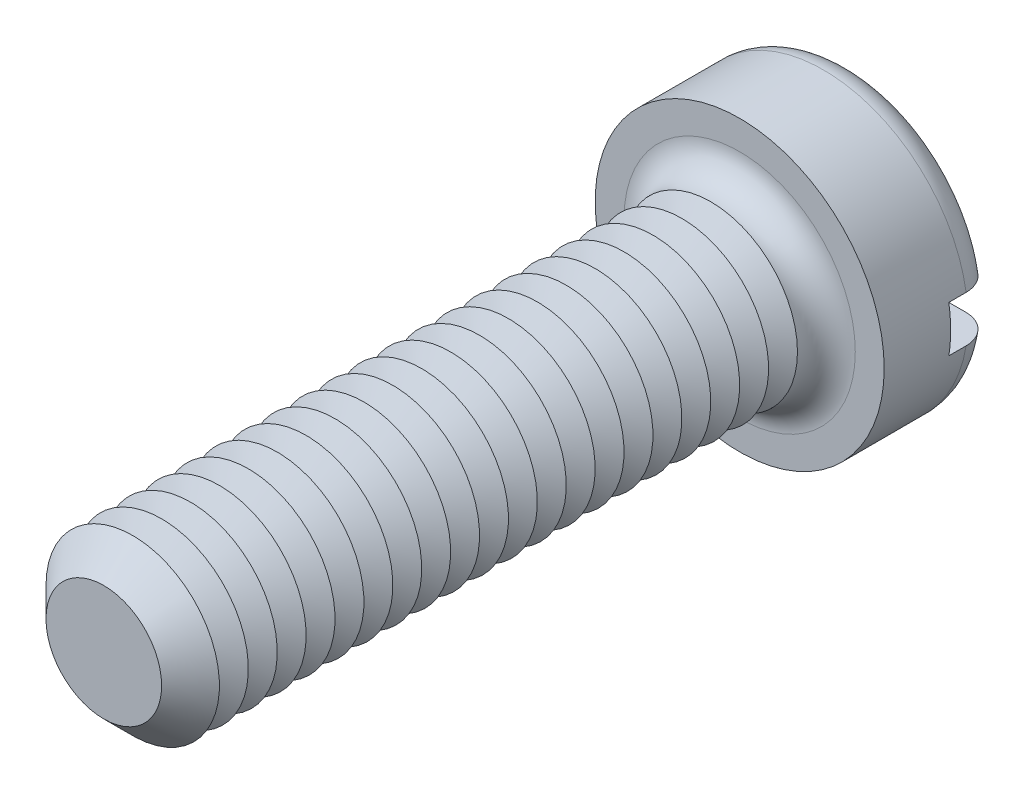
ISO-10303-21;
HEADER;
FILE_DESCRIPTION(('STEP AP214'),'2;1');
FILE_NAME('part.step','',(''),(''),'','','');
FILE_SCHEMA(('AUTOMOTIVE_DESIGN { 1 0 10303 214 1 1 1 1 }'));
ENDSEC;
DATA;
#1=APPLICATION_CONTEXT('core data for automotive mechanical design processes');
#2=APPLICATION_PROTOCOL_DEFINITION('international standard','automotive_design',2000,#1);
#3=PRODUCT_CONTEXT('',#1,'mechanical');
#4=PRODUCT('Part','Part','',(#3));
#5=PRODUCT_RELATED_PRODUCT_CATEGORY('part','',(#4));
#6=PRODUCT_DEFINITION_FORMATION('','',#4);
#7=PRODUCT_DEFINITION_CONTEXT('part definition',#1,'design');
#8=PRODUCT_DEFINITION('design','',#6,#7);
#9=PRODUCT_DEFINITION_SHAPE('','',#8);
#10=(LENGTH_UNIT() NAMED_UNIT(*) SI_UNIT(.MILLI.,.METRE.));
#11=(NAMED_UNIT(*) PLANE_ANGLE_UNIT() SI_UNIT($,.RADIAN.));
#12=(NAMED_UNIT(*) SI_UNIT($,.STERADIAN.) SOLID_ANGLE_UNIT());
#13=UNCERTAINTY_MEASURE_WITH_UNIT(LENGTH_MEASURE(1.E-05),#10,'distance_accuracy_value','');
#14=(GEOMETRIC_REPRESENTATION_CONTEXT(3) GLOBAL_UNCERTAINTY_ASSIGNED_CONTEXT((#13)) GLOBAL_UNIT_ASSIGNED_CONTEXT((#10,
#11,#12)) REPRESENTATION_CONTEXT('',''));
#15=CARTESIAN_POINT('',(0.,0.,0.));
#16=DIRECTION('',(0.,0.,1.));
#17=DIRECTION('',(1.,0.,0.));
#18=AXIS2_PLACEMENT_3D('',#15,#16,#17);
#19=CARTESIAN_POINT('',(0.,0.,-3.9));
#20=DIRECTION('',(0.,0.,1.));
#21=DIRECTION('',(1.,0.,0.));
#22=AXIS2_PLACEMENT_3D('',#19,#20,#21);
#23=PLANE('',#22);
#24=CARTESIAN_POINT('',(0.,0.,-3.9));
#25=DIRECTION('',(0.,0.,1.));
#26=DIRECTION('',(1.,0.,0.));
#27=AXIS2_PLACEMENT_3D('',#24,#25,#26);
#28=CIRCLE('',#27,4.);
#29=CARTESIAN_POINT('',(-3.91918358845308,0.800000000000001,-3.9));
#30=VERTEX_POINT('',#29);
#31=CARTESIAN_POINT('',(3.91918358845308,0.8,-3.9));
#32=VERTEX_POINT('',#31);
#33=EDGE_CURVE('E116',#30,#32,#28,.F.);
#34=ORIENTED_EDGE('',*,*,#33,.T.);
#35=DIRECTION('',(1.,0.,0.));
#36=VECTOR('',#35,1.);
#37=CARTESIAN_POINT('',(-5.,0.800000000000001,-3.9));
#38=LINE('',#37,#36);
#39=EDGE_CURVE('E111',#30,#32,#38,.T.);
#40=ORIENTED_EDGE('',*,*,#39,.F.);
#41=EDGE_LOOP('',(#34,#40));
#42=FACE_BOUND('',#41,.T.);
#43=ADVANCED_FACE('F39',(#42),#23,.F.);
#44=CARTESIAN_POINT('',(0.,0.,-2.9));
#45=DIRECTION('',(0.,0.,1.));
#46=DIRECTION('',(1.,0.,0.));
#47=AXIS2_PLACEMENT_3D('',#44,#45,#46);
#48=TOROIDAL_SURFACE('',#47,4.,1.);
#49=CARTESIAN_POINT('',(-4.76648512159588,0.800000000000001,-3.45304061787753));
#50=CARTESIAN_POINT('',(-4.73486405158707,0.800000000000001,-3.50001565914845));
#51=CARTESIAN_POINT('',(-4.69920787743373,0.800000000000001,-3.54432871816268));
#52=CARTESIAN_POINT('',(-4.62090302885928,0.800000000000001,-3.62634638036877));
#53=CARTESIAN_POINT('',(-4.57824494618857,0.800000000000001,-3.66404194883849));
#54=CARTESIAN_POINT('',(-4.48726975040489,0.800000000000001,-3.73172278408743));
#55=CARTESIAN_POINT('',(-4.43895902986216,0.800000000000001,-3.76171664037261));
#56=CARTESIAN_POINT('',(-4.33804923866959,0.800000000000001,-3.81326437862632));
#57=CARTESIAN_POINT('',(-4.2854512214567,0.800000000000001,-3.8348203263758));
#58=CARTESIAN_POINT('',(-4.17679895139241,0.800000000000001,-3.86918431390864));
#59=CARTESIAN_POINT('',(-4.12071163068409,0.800000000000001,-3.88188775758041));
#60=CARTESIAN_POINT('',(-4.00720729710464,0.800000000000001,-3.89785932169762));
#61=CARTESIAN_POINT('',(-3.94979011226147,0.800000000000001,-3.9011262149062));
#62=CARTESIAN_POINT('',(-3.83429042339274,0.800000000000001,-3.89816676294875));
#63=CARTESIAN_POINT('',(-3.77621176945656,0.800000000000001,-3.89178937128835));
#64=CARTESIAN_POINT('',(-3.66191938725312,0.800000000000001,-3.8694726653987));
#65=CARTESIAN_POINT('',(-3.60570580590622,0.800000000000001,-3.85353259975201));
#66=CARTESIAN_POINT('',(-3.49618749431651,0.800000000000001,-3.81233202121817));
#67=CARTESIAN_POINT('',(-3.44291561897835,0.800000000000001,-3.78698406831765));
#68=CARTESIAN_POINT('',(-3.34140774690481,0.800000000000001,-3.72766098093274));
#69=CARTESIAN_POINT('',(-3.29317182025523,0.800000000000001,-3.69368572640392));
#70=CARTESIAN_POINT('',(-3.20343355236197,0.800000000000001,-3.6182054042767));
#71=CARTESIAN_POINT('',(-3.16189680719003,0.800000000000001,-3.57674128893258));
#72=CARTESIAN_POINT('',(-3.08658236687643,0.800000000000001,-3.48727547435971));
#73=CARTESIAN_POINT('',(-3.05280364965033,0.800000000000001,-3.43927463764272));
#74=CARTESIAN_POINT('',(-2.99489532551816,0.800000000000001,-3.33932895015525));
#75=CARTESIAN_POINT('',(-2.97055012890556,0.800000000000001,-3.28750911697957));
#76=CARTESIAN_POINT('',(-2.93124252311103,0.800000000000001,-3.18042600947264));
#77=CARTESIAN_POINT('',(-2.91627793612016,0.800000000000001,-3.12516353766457));
#78=CARTESIAN_POINT('',(-2.89663075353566,0.800000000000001,-3.01470560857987));
#79=CARTESIAN_POINT('',(-2.89162828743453,0.800000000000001,-2.95956691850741));
#80=CARTESIAN_POINT('',(-2.89112479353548,0.800000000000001,-2.84924961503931));
#81=CARTESIAN_POINT('',(-2.89562264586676,0.800000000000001,-2.79407100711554));
#82=CARTESIAN_POINT('',(-2.91379565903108,0.800000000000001,-2.6861912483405));
#83=CARTESIAN_POINT('',(-2.92731815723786,0.800000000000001,-2.63346424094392));
#84=CARTESIAN_POINT('',(-2.96290888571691,0.800000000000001,-2.53098203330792));
#85=CARTESIAN_POINT('',(-2.98497757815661,0.800000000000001,-2.48122699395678));
#86=CARTESIAN_POINT('',(-3.03728055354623,0.800000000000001,-2.38535286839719));
#87=CARTESIAN_POINT('',(-3.06761989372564,0.800000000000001,-2.33929117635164));
#88=CARTESIAN_POINT('',(-3.13537950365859,0.800000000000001,-2.2527125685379));
#89=CARTESIAN_POINT('',(-3.17280082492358,0.800000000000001,-2.21219647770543));
#90=CARTESIAN_POINT('',(-3.2549164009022,0.800000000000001,-2.13651195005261));
#91=CARTESIAN_POINT('',(-3.29980186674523,0.800000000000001,-2.10155095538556));
#92=CARTESIAN_POINT('',(-3.39467666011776,0.800000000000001,-2.03942270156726));
#93=CARTESIAN_POINT('',(-3.44466673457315,0.800000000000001,-2.01225658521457));
#94=CARTESIAN_POINT('',(-3.5497933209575,0.800000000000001,-1.96576935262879));
#95=CARTESIAN_POINT('',(-3.60503228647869,0.800000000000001,-1.94667963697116));
#96=CARTESIAN_POINT('',(-3.71791613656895,0.800000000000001,-1.91794308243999));
#97=CARTESIAN_POINT('',(-3.77556119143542,0.800000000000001,-1.90829691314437));
#98=CARTESIAN_POINT('',(-3.89221522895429,0.800000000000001,-1.89869331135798));
#99=CARTESIAN_POINT('',(-3.9512319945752,0.800000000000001,-1.89882985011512));
#100=CARTESIAN_POINT('',(-4.06839541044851,0.800000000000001,-1.90907818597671));
#101=CARTESIAN_POINT('',(-4.12654207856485,0.800000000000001,-1.91918977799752));
#102=CARTESIAN_POINT('',(-4.23988103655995,0.800000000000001,-1.9490667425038));
#103=CARTESIAN_POINT('',(-4.29509069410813,0.800000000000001,-1.96876615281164));
#104=CARTESIAN_POINT('',(-4.40134194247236,0.800000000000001,-2.01729572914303));
#105=CARTESIAN_POINT('',(-4.45238383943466,0.800000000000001,-2.04612522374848));
#106=CARTESIAN_POINT('',(-4.54801343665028,0.800000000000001,-2.1116316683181));
#107=CARTESIAN_POINT('',(-4.59268768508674,0.800000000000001,-2.14818225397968));
#108=CARTESIAN_POINT('',(-4.67513924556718,0.800000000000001,-2.22837632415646));
#109=CARTESIAN_POINT('',(-4.71291715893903,0.800000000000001,-2.27201918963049));
#110=CARTESIAN_POINT('',(-4.77986554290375,0.800000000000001,-2.36439990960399));
#111=CARTESIAN_POINT('',(-4.80916462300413,0.800000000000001,-2.41304457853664));
#112=CARTESIAN_POINT('',(-4.85906149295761,0.800000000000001,-2.51460659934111));
#113=CARTESIAN_POINT('',(-4.8796602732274,0.800000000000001,-2.56752346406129));
#114=CARTESIAN_POINT('',(-4.9113264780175,0.800000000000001,-2.67542592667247));
#115=CARTESIAN_POINT('',(-4.92250819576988,0.800000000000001,-2.73037800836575));
#116=CARTESIAN_POINT('',(-4.93542682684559,0.800000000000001,-2.84139649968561));
#117=CARTESIAN_POINT('',(-4.93716171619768,0.800000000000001,-2.89746314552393));
#118=CARTESIAN_POINT('',(-4.93114851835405,0.800000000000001,-3.00876455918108));
#119=CARTESIAN_POINT('',(-4.92345325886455,0.800000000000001,-3.0640022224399));
#120=CARTESIAN_POINT('',(-4.8989032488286,0.800000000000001,-3.17235240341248));
#121=CARTESIAN_POINT('',(-4.88205998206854,0.800000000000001,-3.22546749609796));
#122=CARTESIAN_POINT('',(-4.84819200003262,0.800000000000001,-3.30764066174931));
#123=CARTESIAN_POINT('',(-4.83390853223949,0.800000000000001,-3.33785845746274));
#124=CARTESIAN_POINT('',(-4.80237957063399,0.800000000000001,-3.39670633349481));
#125=CARTESIAN_POINT('',(-4.78513409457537,0.800000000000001,-3.42533642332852));
#126=CARTESIAN_POINT('',(-4.76648512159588,0.800000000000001,-3.45304061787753));
#127=B_SPLINE_CURVE_WITH_KNOTS('',3,(#49,#50,#51,#52,#53,#54,#55,#56,#57,#58,#59,#60,#61,#62,
#63,#64,#65,#66,#67,#68,#69,#70,#71,#72,#73,#74,#75,#76,#77,#78,#79,#80,#81,#82,#83,#84,#85,#86,
#87,#88,#89,#90,#91,#92,#93,#94,#95,#96,#97,#98,#99,#100,#101,#102,#103,#104,#105,#106,#107,
#108,#109,#110,#111,#112,#113,#114,#115,#116,#117,#118,#119,#120,#121,#122,#123,#124,#125,#126),
.UNSPECIFIED.,.T.,.F.,(4,2,2,2,2,2,2,2,2,2,2,2,2,2,2,2,2,2,2,2,2,2,2,2,2,2,2,2,2,2,2,2,2,2,2,2,
2,2,4),(0.,0.169755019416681,0.339740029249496,0.509534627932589,0.67928763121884,
0.851013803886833,1.02276230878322,1.19722869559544,1.37170879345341,1.54785292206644,
1.72399950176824,1.89921049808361,2.07439839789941,2.24530597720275,2.41617386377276,
2.58146078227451,2.74672821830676,2.90926852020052,3.0718176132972,3.2365363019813,
3.40127946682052,3.57118676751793,3.74111896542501,3.91563534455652,4.09016409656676,
4.26636956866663,4.4425714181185,4.61757781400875,4.79257134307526,4.96489650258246,
5.13720662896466,5.30674670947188,5.47626748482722,5.64369988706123,5.81116816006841,
5.97770254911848,6.14402836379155,6.24414438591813,6.34425980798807),.UNSPECIFIED.);
#128=CARTESIAN_POINT('',(-4.93558507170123,0.800000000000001,-2.9));
#129=VERTEX_POINT('',#128);
#130=EDGE_CURVE('E338',#129,#30,#127,.T.);
#131=ORIENTED_EDGE('',*,*,#130,.F.);
#132=CARTESIAN_POINT('',(0.,0.,-2.9));
#133=DIRECTION('',(0.,0.,1.));
#134=DIRECTION('',(1.,0.,0.));
#135=AXIS2_PLACEMENT_3D('',#132,#133,#134);
#136=CIRCLE('',#135,5.);
#137=CARTESIAN_POINT('',(4.93558507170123,0.8,-2.9));
#138=VERTEX_POINT('',#137);
#139=EDGE_CURVE('E124',#138,#129,#136,.T.);
#140=ORIENTED_EDGE('',*,*,#139,.F.);
#141=CARTESIAN_POINT('',(2.98553785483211,0.8,-3.31649797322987));
#142=CARTESIAN_POINT('',(3.00991125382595,0.8,-3.36788093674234));
#143=CARTESIAN_POINT('',(3.03875556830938,0.8,-3.41719756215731));
#144=CARTESIAN_POINT('',(3.1043993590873,0.8,-3.51028676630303));
#145=CARTESIAN_POINT('',(3.1412115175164,0.8,-3.55405032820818));
#146=CARTESIAN_POINT('',(3.22153641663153,0.8,-3.63476402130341));
#147=CARTESIAN_POINT('',(3.26503706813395,0.8,-3.67172618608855));
#148=CARTESIAN_POINT('',(3.35749627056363,0.8,-3.73799476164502));
#149=CARTESIAN_POINT('',(3.4064533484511,0.8,-3.76730323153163));
#150=CARTESIAN_POINT('',(3.5095773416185,0.8,-3.81809642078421));
#151=CARTESIAN_POINT('',(3.56383317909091,0.8,-3.83940072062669));
#152=CARTESIAN_POINT('',(3.67513017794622,0.8,-3.87272481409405));
#153=CARTESIAN_POINT('',(3.7321717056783,0.8,-3.88474338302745));
#154=CARTESIAN_POINT('',(3.84815688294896,0.8,-3.89923413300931));
#155=CARTESIAN_POINT('',(3.90711516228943,0.8,-3.9015896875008));
#156=CARTESIAN_POINT('',(4.02458610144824,0.8,-3.89631753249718));
#157=CARTESIAN_POINT('',(4.08309876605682,0.8,-3.8886899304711));
#158=CARTESIAN_POINT('',(4.19768646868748,0.8,-3.86366584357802));
#159=CARTESIAN_POINT('',(4.25377243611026,0.8,-3.84631948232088));
#160=CARTESIAN_POINT('',(4.3621676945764,0.8,-3.80231797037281));
#161=CARTESIAN_POINT('',(4.41447726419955,0.8,-3.77566350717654));
#162=CARTESIAN_POINT('',(4.51300872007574,0.8,-3.71421163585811));
#163=CARTESIAN_POINT('',(4.5593085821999,0.8,-3.67953927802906));
#164=CARTESIAN_POINT('',(4.64530675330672,0.8,-3.60279495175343));
#165=CARTESIAN_POINT('',(4.68500564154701,0.8,-3.56072363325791));
#166=CARTESIAN_POINT('',(4.75599202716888,0.8,-3.47111750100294));
#167=CARTESIAN_POINT('',(4.7874061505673,0.8,-3.42368298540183));
#168=CARTESIAN_POINT('',(4.84170328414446,0.8,-3.32415927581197));
#169=CARTESIAN_POINT('',(4.86458695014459,0.8,-3.2720704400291));
#170=CARTESIAN_POINT('',(4.90088120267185,0.8,-3.16544016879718));
#171=CARTESIAN_POINT('',(4.91440984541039,0.8,-3.11093889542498));
#172=CARTESIAN_POINT('',(4.93205429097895,0.8,-3.00043391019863));
#173=CARTESIAN_POINT('',(4.93617053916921,0.8,-2.9444302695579));
#174=CARTESIAN_POINT('',(4.93486973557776,0.8,-2.83292218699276));
#175=CARTESIAN_POINT('',(4.92951827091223,0.8,-2.77741696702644));
#176=CARTESIAN_POINT('',(4.90957104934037,0.8,-2.66809456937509));
#177=CARTESIAN_POINT('',(4.89497541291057,0.8,-2.61427736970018));
#178=CARTESIAN_POINT('',(4.85697876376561,0.8,-2.50985095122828));
#179=CARTESIAN_POINT('',(4.83357805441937,0.8,-2.45924162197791));
#180=CARTESIAN_POINT('',(4.77866660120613,0.8,-2.36263484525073));
#181=CARTESIAN_POINT('',(4.74715567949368,0.8,-2.31663749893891));
#182=CARTESIAN_POINT('',(4.67670791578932,0.8,-2.23021464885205));
#183=CARTESIAN_POINT('',(4.6377224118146,0.8,-2.1898288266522));
#184=CARTESIAN_POINT('',(4.55359880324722,0.8,-2.11607828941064));
#185=CARTESIAN_POINT('',(4.50846036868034,0.8,-2.08271395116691));
#186=CARTESIAN_POINT('',(4.41271544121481,0.8,-2.02349513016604));
#187=CARTESIAN_POINT('',(4.36204749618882,0.8,-1.99774003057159));
#188=CARTESIAN_POINT('',(4.257155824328,0.8,-1.95495040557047));
#189=CARTESIAN_POINT('',(4.20293181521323,0.8,-1.93791657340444));
#190=CARTESIAN_POINT('',(4.09154156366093,0.8,-1.91276335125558));
#191=CARTESIAN_POINT('',(4.03434212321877,0.8,-1.90479098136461));
#192=CARTESIAN_POINT('',(3.91941228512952,0.8,-1.89840884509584));
#193=CARTESIAN_POINT('',(3.8616818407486,0.8,-1.89999992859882));
#194=CARTESIAN_POINT('',(3.7464111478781,0.8,-1.91275144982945));
#195=CARTESIAN_POINT('',(3.6888866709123,0.8,-1.92405471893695));
#196=CARTESIAN_POINT('',(3.57652290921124,0.8,-1.95609086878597));
#197=CARTESIAN_POINT('',(3.52168382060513,0.8,-1.97682443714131));
#198=CARTESIAN_POINT('',(3.41589179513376,0.8,-2.02733294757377));
#199=CARTESIAN_POINT('',(3.36496676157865,0.8,-2.05716640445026));
#200=CARTESIAN_POINT('',(3.26890903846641,0.8,-2.12504079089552));
#201=CARTESIAN_POINT('',(3.22377627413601,0.8,-2.16308161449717));
#202=CARTESIAN_POINT('',(3.141135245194,0.8,-2.24593284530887));
#203=CARTESIAN_POINT('',(3.1035541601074,0.8,-2.29067053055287));
#204=CARTESIAN_POINT('',(3.03669700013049,0.8,-2.38597317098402));
#205=CARTESIAN_POINT('',(3.00741914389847,0.8,-2.43653687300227));
#206=CARTESIAN_POINT('',(2.95891799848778,0.8,-2.54052959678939));
#207=CARTESIAN_POINT('',(2.93943249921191,0.8,-2.59383627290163));
#208=CARTESIAN_POINT('',(2.9100081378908,0.8,-2.70303736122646));
#209=CARTESIAN_POINT('',(2.90006970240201,0.8,-2.75893188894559));
#210=CARTESIAN_POINT('',(2.89027863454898,0.8,-2.86986958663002));
#211=CARTESIAN_POINT('',(2.89012791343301,0.8,-2.92488680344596));
#212=CARTESIAN_POINT('',(2.89917145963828,0.8,-3.03409648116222));
#213=CARTESIAN_POINT('',(2.90835313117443,0.8,-3.08828995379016));
#214=CARTESIAN_POINT('',(2.92977618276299,0.8,-3.17141652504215));
#215=CARTESIAN_POINT('',(2.93899011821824,0.8,-3.20116372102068));
#216=CARTESIAN_POINT('',(2.96020249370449,0.8,-3.25964614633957));
#217=CARTESIAN_POINT('',(2.97220082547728,0.8,-3.28838141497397));
#218=CARTESIAN_POINT('',(2.98553785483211,0.8,-3.31649797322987));
#219=B_SPLINE_CURVE_WITH_KNOTS('',3,(#141,#142,#143,#144,#145,#146,#147,#148,#149,#150,#151,
#152,#153,#154,#155,#156,#157,#158,#159,#160,#161,#162,#163,#164,#165,#166,#167,#168,#169,#170,
#171,#172,#173,#174,#175,#176,#177,#178,#179,#180,#181,#182,#183,#184,#185,#186,#187,#188,#189,
#190,#191,#192,#193,#194,#195,#196,#197,#198,#199,#200,#201,#202,#203,#204,#205,#206,#207,#208,
#209,#210,#211,#212,#213,#214,#215,#216,#217,#218),.UNSPECIFIED.,.T.,.F.,(4,2,2,2,2,2,2,2,2,2,2,
2,2,2,2,2,2,2,2,2,2,2,2,2,2,2,2,2,2,2,2,2,2,2,2,2,2,2,4),(0.,0.170493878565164,
0.341261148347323,0.511723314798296,0.682139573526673,0.856194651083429,1.03027268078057,
1.20644565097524,1.38261672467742,1.55788746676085,1.73314526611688,1.90583484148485,
2.07850925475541,2.24836742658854,2.41821253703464,2.58587311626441,2.75352576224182,
2.92002154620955,3.08651516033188,3.25300303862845,3.41949456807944,3.58710926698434,
3.75473295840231,3.92445790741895,4.09419634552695,4.26665110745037,4.43912119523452,
4.61417197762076,4.78923552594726,4.96544940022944,5.1416609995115,5.31608191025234,
5.49046537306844,5.65989063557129,5.82932346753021,5.99359365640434,6.157642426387,
6.250939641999,6.34423323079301),.UNSPECIFIED.);
#220=EDGE_CURVE('E340',#32,#138,#219,.T.);
#221=ORIENTED_EDGE('',*,*,#220,.F.);
#222=ORIENTED_EDGE('',*,*,#33,.F.);
#223=EDGE_LOOP('',(#131,#140,#221,#222));
#224=FACE_BOUND('',#223,.T.);
#225=ADVANCED_FACE('F322',(#224),#48,.T.);
#226=CARTESIAN_POINT('',(0.,0.,-3.9));
#227=DIRECTION('',(0.,0.,1.));
#228=DIRECTION('',(1.,0.,0.));
#229=AXIS2_PLACEMENT_3D('',#226,#227,#228);
#230=CYLINDRICAL_SURFACE('',#229,5.);
#231=DIRECTION('',(0.,0.,1.));
#232=VECTOR('',#231,1.);
#233=CARTESIAN_POINT('',(4.93558507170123,0.8,-3.9));
#234=LINE('',#233,#232);
#235=CARTESIAN_POINT('',(4.93558507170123,0.8,-2.3));
#236=VERTEX_POINT('',#235);
#237=EDGE_CURVE('E356',#138,#236,#234,.T.);
#238=ORIENTED_EDGE('',*,*,#237,.F.);
#239=ORIENTED_EDGE('',*,*,#139,.T.);
#240=DIRECTION('',(0.,0.,1.));
#241=VECTOR('',#240,1.);
#242=CARTESIAN_POINT('',(-4.93558507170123,0.800000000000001,-3.9));
#243=LINE('',#242,#241);
#244=CARTESIAN_POINT('',(-4.93558507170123,0.800000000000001,-2.3));
#245=VERTEX_POINT('',#244);
#246=EDGE_CURVE('E63',#245,#129,#243,.F.);
#247=ORIENTED_EDGE('',*,*,#246,.F.);
#248=CARTESIAN_POINT('',(0.,0.,-2.3));
#249=DIRECTION('',(0.,0.,-1.));
#250=DIRECTION('',(-1.,0.,0.));
#251=AXIS2_PLACEMENT_3D('',#248,#249,#250);
#252=CIRCLE('',#251,5.);
#253=CARTESIAN_POINT('',(-4.93558507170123,-0.799999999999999,-2.3));
#254=VERTEX_POINT('',#253);
#255=EDGE_CURVE('E43',#245,#254,#252,.F.);
#256=ORIENTED_EDGE('',*,*,#255,.T.);
#257=DIRECTION('',(0.,0.,1.));
#258=VECTOR('',#257,1.);
#259=CARTESIAN_POINT('',(-4.93558507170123,-0.799999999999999,-3.9));
#260=LINE('',#259,#258);
#261=CARTESIAN_POINT('',(-4.93558507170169,-0.799999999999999,-2.89999999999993));
#262=VERTEX_POINT('',#261);
#263=EDGE_CURVE('E353',#262,#254,#260,.T.);
#264=ORIENTED_EDGE('',*,*,#263,.F.);
#265=CARTESIAN_POINT('',(4.93558507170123,-0.8,-2.9));
#266=VERTEX_POINT('',#265);
#267=EDGE_CURVE('E126',#262,#266,#136,.T.);
#268=ORIENTED_EDGE('',*,*,#267,.T.);
#269=DIRECTION('',(0.,0.,1.));
#270=VECTOR('',#269,1.);
#271=CARTESIAN_POINT('',(4.93558507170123,-0.8,-3.9));
#272=LINE('',#271,#270);
#273=CARTESIAN_POINT('',(4.93558507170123,-0.8,-2.3));
#274=VERTEX_POINT('',#273);
#275=EDGE_CURVE('E55',#274,#266,#272,.F.);
#276=ORIENTED_EDGE('',*,*,#275,.F.);
#277=EDGE_CURVE('E11',#274,#236,#252,.F.);
#278=ORIENTED_EDGE('',*,*,#277,.T.);
#279=EDGE_LOOP('',(#238,#239,#247,#256,#264,#268,#276,#278));
#280=FACE_BOUND('',#279,.T.);
#281=CARTESIAN_POINT('',(0.,0.,0.));
#282=DIRECTION('',(0.,0.,1.));
#283=DIRECTION('',(1.,0.,0.));
#284=AXIS2_PLACEMENT_3D('',#281,#282,#283);
#285=CIRCLE('',#284,5.);
#286=CARTESIAN_POINT('',(5.,0.,0.));
#287=VERTEX_POINT('',#286);
#288=EDGE_CURVE('E359',#287,#287,#285,.T.);
#289=ORIENTED_EDGE('',*,*,#288,.F.);
#290=EDGE_LOOP('',(#289));
#291=FACE_BOUND('',#290,.T.);
#292=ADVANCED_FACE('F318',(#280,#291),#230,.T.);
#293=CARTESIAN_POINT('',(3.91918358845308,-0.8,-3.9));
#294=VERTEX_POINT('',#293);
#295=CARTESIAN_POINT('',(-3.91918358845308,-0.799999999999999,-3.9));
#296=VERTEX_POINT('',#295);
#297=EDGE_CURVE('E109',#294,#296,#28,.F.);
#298=ORIENTED_EDGE('',*,*,#297,.T.);
#299=DIRECTION('',(-1.,0.,0.));
#300=VECTOR('',#299,1.);
#301=CARTESIAN_POINT('',(-5.,-0.799999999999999,-3.9));
#302=LINE('',#301,#300);
#303=EDGE_CURVE('E96',#294,#296,#302,.T.);
#304=ORIENTED_EDGE('',*,*,#303,.F.);
#305=EDGE_LOOP('',(#298,#304));
#306=FACE_BOUND('',#305,.T.);
#307=ADVANCED_FACE('F108',(#306),#23,.F.);
#308=CARTESIAN_POINT('',(0.,0.,0.));
#309=DIRECTION('',(0.,0.,1.));
#310=DIRECTION('',(1.,0.,0.));
#311=AXIS2_PLACEMENT_3D('',#308,#309,#310);
#312=PLANE('',#311);
#313=CARTESIAN_POINT('',(0.,0.,0.));
#314=DIRECTION('',(0.,0.,1.));
#315=DIRECTION('',(1.,0.,0.));
#316=AXIS2_PLACEMENT_3D('',#313,#314,#315);
#317=CIRCLE('',#316,4.);
#318=CARTESIAN_POINT('',(4.,0.,0.));
#319=VERTEX_POINT('',#318);
#320=EDGE_CURVE('E115',#319,#319,#317,.F.);
#321=ORIENTED_EDGE('',*,*,#320,.T.);
#322=EDGE_LOOP('',(#321));
#323=FACE_BOUND('',#322,.T.);
#324=ORIENTED_EDGE('',*,*,#288,.T.);
#325=EDGE_LOOP('',(#324));
#326=FACE_BOUND('',#325,.T.);
#327=ADVANCED_FACE('F317',(#323,#326),#312,.T.);
#328=CARTESIAN_POINT('',(-4.76648512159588,-0.799999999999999,-3.45304061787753));
#329=CARTESIAN_POINT('',(-4.7975694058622,-0.799999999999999,-3.40685392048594));
#330=CARTESIAN_POINT('',(-4.82479903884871,-0.799999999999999,-3.35802740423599));
#331=CARTESIAN_POINT('',(-4.87070632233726,-0.799999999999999,-3.25646127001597));
#332=CARTESIAN_POINT('',(-4.8893747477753,-0.799999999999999,-3.20371750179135));
#333=CARTESIAN_POINT('',(-4.91756720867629,-0.799999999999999,-3.09584501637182));
#334=CARTESIAN_POINT('',(-4.92709302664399,-0.799999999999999,-3.04071676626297));
#335=CARTESIAN_POINT('',(-4.93671217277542,-0.799999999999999,-2.92965669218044));
#336=CARTESIAN_POINT('',(-4.93680767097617,-0.799999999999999,-2.87372505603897));
#337=CARTESIAN_POINT('',(-4.92758675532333,-0.799999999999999,-2.76284675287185));
#338=CARTESIAN_POINT('',(-4.91830421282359,-0.799999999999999,-2.70789726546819));
#339=CARTESIAN_POINT('',(-4.89065741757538,-0.799999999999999,-2.60033228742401));
#340=CARTESIAN_POINT('',(-4.87229291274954,-0.799999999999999,-2.54771686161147));
#341=CARTESIAN_POINT('',(-4.82699855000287,-0.799999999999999,-2.44622441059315));
#342=CARTESIAN_POINT('',(-4.80005659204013,-0.799999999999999,-2.39735278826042));
#343=CARTESIAN_POINT('',(-4.73841244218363,-0.799999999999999,-2.30477947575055));
#344=CARTESIAN_POINT('',(-4.70371003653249,-0.799999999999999,-2.26107792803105));
#345=CARTESIAN_POINT('',(-4.62724516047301,-0.799999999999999,-2.17969334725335));
#346=CARTESIAN_POINT('',(-4.58542787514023,-0.799999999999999,-2.14206183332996));
#347=CARTESIAN_POINT('',(-4.49614171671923,-0.799999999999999,-2.07424284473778));
#348=CARTESIAN_POINT('',(-4.44867251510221,-0.799999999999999,-2.04405580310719));
#349=CARTESIAN_POINT('',(-4.34875035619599,-0.799999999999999,-1.99153688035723));
#350=CARTESIAN_POINT('',(-4.29623870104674,-0.799999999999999,-1.96931670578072));
#351=CARTESIAN_POINT('',(-4.18826905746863,-0.799999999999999,-1.93384994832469));
#352=CARTESIAN_POINT('',(-4.1328108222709,-0.799999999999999,-1.92060411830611));
#353=CARTESIAN_POINT('',(-4.01956054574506,-0.799999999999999,-1.90323798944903));
#354=CARTESIAN_POINT('',(-3.96174522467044,-0.799999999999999,-1.89926947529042));
#355=CARTESIAN_POINT('',(-3.84625419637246,-0.799999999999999,-1.90095183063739));
#356=CARTESIAN_POINT('',(-3.78857850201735,-0.799999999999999,-1.90660355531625));
#357=CARTESIAN_POINT('',(-3.67415602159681,-0.799999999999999,-1.92748272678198));
#358=CARTESIAN_POINT('',(-3.61743328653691,-0.799999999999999,-1.94284216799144));
#359=CARTESIAN_POINT('',(-3.50734962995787,-0.799999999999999,-1.9828275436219));
#360=CARTESIAN_POINT('',(-3.4539889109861,-0.799999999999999,-2.00745403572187));
#361=CARTESIAN_POINT('',(-3.35197118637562,-0.799999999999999,-2.06542964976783));
#362=CARTESIAN_POINT('',(-3.30333217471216,-0.799999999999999,-2.0988104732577));
#363=CARTESIAN_POINT('',(-3.21244692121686,-0.799999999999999,-2.17337326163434));
#364=CARTESIAN_POINT('',(-3.17020039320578,-0.799999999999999,-2.21455487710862));
#365=CARTESIAN_POINT('',(-3.0940098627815,-0.799999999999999,-2.30296695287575));
#366=CARTESIAN_POINT('',(-3.05995540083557,-0.799999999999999,-2.35010211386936));
#367=CARTESIAN_POINT('',(-3.00053815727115,-0.799999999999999,-2.4495670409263));
#368=CARTESIAN_POINT('',(-2.97517362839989,-0.799999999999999,-2.50189576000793));
#369=CARTESIAN_POINT('',(-2.93470320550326,-0.799999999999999,-2.60853979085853));
#370=CARTESIAN_POINT('',(-2.91930557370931,-0.799999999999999,-2.66274437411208));
#371=CARTESIAN_POINT('',(-2.89812734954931,-0.799999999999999,-2.77299836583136));
#372=CARTESIAN_POINT('',(-2.89234481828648,-0.799999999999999,-2.82904740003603));
#373=CARTESIAN_POINT('',(-2.89064073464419,-0.799999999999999,-2.93970612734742));
#374=CARTESIAN_POINT('',(-2.89444549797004,-0.799999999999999,-2.99431180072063));
#375=CARTESIAN_POINT('',(-2.9112006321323,-0.799999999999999,-3.10209766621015));
#376=CARTESIAN_POINT('',(-2.9241507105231,-0.799999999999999,-3.1552779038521));
#377=CARTESIAN_POINT('',(-2.95868580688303,-0.799999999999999,-3.25858631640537));
#378=CARTESIAN_POINT('',(-2.98024709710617,-0.799999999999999,-3.30872244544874));
#379=CARTESIAN_POINT('',(-3.03128544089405,-0.799999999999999,-3.40478519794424));
#380=CARTESIAN_POINT('',(-3.06076335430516,-0.799999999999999,-3.45071136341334));
#381=CARTESIAN_POINT('',(-3.12753448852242,-0.799999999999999,-3.53826932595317));
#382=CARTESIAN_POINT('',(-3.16500083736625,-0.799999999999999,-3.57976901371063));
#383=CARTESIAN_POINT('',(-3.24617503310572,-0.799999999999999,-3.65613204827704));
#384=CARTESIAN_POINT('',(-3.28988388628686,-0.799999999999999,-3.69099432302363));
#385=CARTESIAN_POINT('',(-3.38380639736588,-0.799999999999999,-3.75424083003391));
#386=CARTESIAN_POINT('',(-3.43418287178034,-0.799999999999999,-3.78238342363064));
#387=CARTESIAN_POINT('',(-3.53887888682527,-0.799999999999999,-3.83000231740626));
#388=CARTESIAN_POINT('',(-3.59319889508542,-0.799999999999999,-3.84947758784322));
#389=CARTESIAN_POINT('',(-3.70539237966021,-0.799999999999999,-3.87954336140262));
#390=CARTESIAN_POINT('',(-3.76331464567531,-0.799999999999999,-3.88995217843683));
#391=CARTESIAN_POINT('',(-3.88008461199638,-0.799999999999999,-3.9009132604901));
#392=CARTESIAN_POINT('',(-3.93893230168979,-0.799999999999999,-3.9014656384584));
#393=CARTESIAN_POINT('',(-4.05594892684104,-0.799999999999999,-3.89264187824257));
#394=CARTESIAN_POINT('',(-4.11411702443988,-0.799999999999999,-3.88325457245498));
#395=CARTESIAN_POINT('',(-4.22802928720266,-0.799999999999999,-3.85472582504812));
#396=CARTESIAN_POINT('',(-4.28377297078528,-0.799999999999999,-3.83558245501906));
#397=CARTESIAN_POINT('',(-4.39054463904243,-0.799999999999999,-3.78829842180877));
#398=CARTESIAN_POINT('',(-4.44161887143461,-0.799999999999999,-3.76026208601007));
#399=CARTESIAN_POINT('',(-4.53818016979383,-0.799999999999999,-3.69589278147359));
#400=CARTESIAN_POINT('',(-4.58367442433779,-0.799999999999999,-3.65957066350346));
#401=CARTESIAN_POINT('',(-4.65208830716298,-0.799999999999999,-3.59453310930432));
#402=CARTESIAN_POINT('',(-4.67711825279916,-0.799999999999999,-3.56800018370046));
#403=CARTESIAN_POINT('',(-4.72414423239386,-0.799999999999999,-3.51236863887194));
#404=CARTESIAN_POINT('',(-4.74614029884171,-0.799999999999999,-3.48327004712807));
#405=CARTESIAN_POINT('',(-4.76648512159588,-0.799999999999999,-3.45304061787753));
#406=B_SPLINE_CURVE_WITH_KNOTS('',3,(#328,#329,#330,#331,#332,#333,#334,#335,#336,#337,#338,
#339,#340,#341,#342,#343,#344,#345,#346,#347,#348,#349,#350,#351,#352,#353,#354,#355,#356,#357,
#358,#359,#360,#361,#362,#363,#364,#365,#366,#367,#368,#369,#370,#371,#372,#373,#374,#375,#376,
#377,#378,#379,#380,#381,#382,#383,#384,#385,#386,#387,#388,#389,#390,#391,#392,#393,#394,#395,
#396,#397,#398,#399,#400,#401,#402,#403,#404,#405),.UNSPECIFIED.,.T.,.F.,(4,2,2,2,2,2,2,2,2,2,2,
2,2,2,2,2,2,2,2,2,2,2,2,2,2,2,2,2,2,2,2,2,2,2,2,2,2,2,4),(0.,0.166886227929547,
0.333951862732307,0.500984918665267,0.667979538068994,0.834373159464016,1.00077139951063,
1.16740542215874,1.33404403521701,1.50202999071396,1.67002571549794,1.84029248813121,
2.01057354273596,2.18362161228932,2.35668506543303,2.53215380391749,2.70763310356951,
2.88375684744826,3.05987270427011,3.23346085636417,3.40701408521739,3.57522519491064,
3.74340238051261,3.90683338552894,4.0702591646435,4.23323770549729,4.39623395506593,
4.56320691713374,4.7302068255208,4.90252468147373,5.07486300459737,5.25058028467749,
5.42629555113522,5.60220844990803,5.77815613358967,5.95211162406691,6.12584060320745,
6.23506966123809,6.34429754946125),.UNSPECIFIED.);
#407=EDGE_CURVE('E103',#296,#262,#406,.T.);
#408=ORIENTED_EDGE('',*,*,#407,.F.);
#409=ORIENTED_EDGE('',*,*,#297,.F.);
#410=CARTESIAN_POINT('',(2.98553785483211,-0.8,-3.31649797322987));
#411=CARTESIAN_POINT('',(2.96216773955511,-0.8,-3.26721849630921));
#412=CARTESIAN_POINT('',(2.94287503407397,-0.8,-3.21596872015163));
#413=CARTESIAN_POINT('',(2.91313258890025,-0.8,-3.11092723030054));
#414=CARTESIAN_POINT('',(2.9026902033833,-0.8,-3.0571334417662));
#415=CARTESIAN_POINT('',(2.89104377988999,-0.8,-2.94853922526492));
#416=CARTESIAN_POINT('',(2.88984130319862,-0.8,-2.89373862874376));
#417=CARTESIAN_POINT('',(2.89672585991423,-0.8,-2.78473646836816));
#418=CARTESIAN_POINT('',(2.90481120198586,-0.8,-2.73053479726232));
#419=CARTESIAN_POINT('',(2.92989134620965,-0.8,-2.62460092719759));
#420=CARTESIAN_POINT('',(2.94682969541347,-0.8,-2.57285532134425));
#421=CARTESIAN_POINT('',(2.9889990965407,-0.8,-2.47286425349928));
#422=CARTESIAN_POINT('',(3.01423103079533,-0.8,-2.42461916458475));
#423=CARTESIAN_POINT('',(3.07271536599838,-0.8,-2.33201565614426));
#424=CARTESIAN_POINT('',(3.10610710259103,-0.8,-2.28774532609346));
#425=CARTESIAN_POINT('',(3.17963417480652,-0.8,-2.205215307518));
#426=CARTESIAN_POINT('',(3.21977054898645,-0.8,-2.16695654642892));
#427=CARTESIAN_POINT('',(3.3070361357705,-0.8,-2.09624274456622));
#428=CARTESIAN_POINT('',(3.35434874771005,-0.8,-2.06401396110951));
#429=CARTESIAN_POINT('',(3.45361131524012,-0.8,-2.00773436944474));
#430=CARTESIAN_POINT('',(3.50556189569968,-0.8,-1.98368466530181));
#431=CARTESIAN_POINT('',(3.61398433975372,-0.8,-1.94389460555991));
#432=CARTESIAN_POINT('',(3.67053506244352,-0.8,-1.92836880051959));
#433=CARTESIAN_POINT('',(3.78543606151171,-0.8,-1.90696594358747));
#434=CARTESIAN_POINT('',(3.84378643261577,-0.8,-1.90108940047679));
#435=CARTESIAN_POINT('',(3.96100201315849,-0.8,-1.89918115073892));
#436=CARTESIAN_POINT('',(4.01986821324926,-0.8,-1.90320860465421));
#437=CARTESIAN_POINT('',(4.13606891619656,-0.8,-1.9211820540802));
#438=CARTESIAN_POINT('',(4.19340347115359,-0.8,-1.93512771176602));
#439=CARTESIAN_POINT('',(4.30434213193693,-0.8,-1.97243705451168));
#440=CARTESIAN_POINT('',(4.35797549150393,-0.8,-1.99571368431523));
#441=CARTESIAN_POINT('',(4.46048254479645,-0.8,-2.0510826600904));
#442=CARTESIAN_POINT('',(4.50935662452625,-0.8,-2.08317429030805));
#443=CARTESIAN_POINT('',(4.60012348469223,-0.8,-2.15471647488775));
#444=CARTESIAN_POINT('',(4.64211506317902,-0.8,-2.19404167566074));
#445=CARTESIAN_POINT('',(4.71877054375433,-0.8,-2.27928299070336));
#446=CARTESIAN_POINT('',(4.75343508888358,-0.8,-2.32519852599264));
#447=CARTESIAN_POINT('',(4.81388799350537,-0.8,-2.4215411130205));
#448=CARTESIAN_POINT('',(4.83980652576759,-0.8,-2.47188650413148));
#449=CARTESIAN_POINT('',(4.88271402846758,-0.8,-2.57624865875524));
#450=CARTESIAN_POINT('',(4.89970360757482,-0.8,-2.63026517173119));
#451=CARTESIAN_POINT('',(4.92409334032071,-0.8,-2.73978844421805));
#452=CARTESIAN_POINT('',(4.93159814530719,-0.8,-2.79527191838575));
#453=CARTESIAN_POINT('',(4.93713723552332,-0.8,-2.90670881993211));
#454=CARTESIAN_POINT('',(4.9351718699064,-0.8,-2.9626622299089));
#455=CARTESIAN_POINT('',(4.92186293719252,-0.8,-3.07317093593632));
#456=CARTESIAN_POINT('',(4.91056393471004,-0.8,-3.12773160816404));
#457=CARTESIAN_POINT('',(4.87898532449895,-0.8,-3.234187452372));
#458=CARTESIAN_POINT('',(4.85870572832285,-0.8,-3.28608262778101));
#459=CARTESIAN_POINT('',(4.80971634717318,-0.8,-3.38586723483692));
#460=CARTESIAN_POINT('',(4.78098824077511,-0.8,-3.43374766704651));
#461=CARTESIAN_POINT('',(4.71596686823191,-0.8,-3.52405937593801));
#462=CARTESIAN_POINT('',(4.67967336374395,-0.8,-3.56649048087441));
#463=CARTESIAN_POINT('',(4.60022577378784,-0.8,-3.64511036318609));
#464=CARTESIAN_POINT('',(4.5570143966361,-0.8,-3.6812412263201));
#465=CARTESIAN_POINT('',(4.4652099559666,-0.8,-3.7458530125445));
#466=CARTESIAN_POINT('',(4.41661654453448,-0.8,-3.77433344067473));
#467=CARTESIAN_POINT('',(4.31470683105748,-0.8,-3.82326981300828));
#468=CARTESIAN_POINT('',(4.26133399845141,-0.8,-3.84360800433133));
#469=CARTESIAN_POINT('',(4.15196444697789,-0.8,-3.87519515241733));
#470=CARTESIAN_POINT('',(4.09596750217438,-0.8,-3.88644332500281));
#471=CARTESIAN_POINT('',(3.98196469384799,-0.8,-3.89971870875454));
#472=CARTESIAN_POINT('',(3.92394096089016,-0.8,-3.901592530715));
#473=CARTESIAN_POINT('',(3.8083852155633,-0.8,-3.89570840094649));
#474=CARTESIAN_POINT('',(3.75085322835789,-0.8,-3.88794995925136));
#475=CARTESIAN_POINT('',(3.6371167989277,-0.8,-3.86287824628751));
#476=CARTESIAN_POINT('',(3.58093962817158,-0.8,-3.84544111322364));
#477=CARTESIAN_POINT('',(3.47227948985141,-0.8,-3.80139971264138));
#478=CARTESIAN_POINT('',(3.41979762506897,-0.8,-3.77479272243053));
#479=CARTESIAN_POINT('',(3.31994061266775,-0.8,-3.71304199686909));
#480=CARTESIAN_POINT('',(3.27257854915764,-0.8,-3.67787710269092));
#481=CARTESIAN_POINT('',(3.18459619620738,-0.8,-3.59999704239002));
#482=CARTESIAN_POINT('',(3.14396747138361,-0.8,-3.55729146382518));
#483=CARTESIAN_POINT('',(3.08341110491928,-0.8,-3.48140072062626));
#484=CARTESIAN_POINT('',(3.06118126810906,-0.8,-3.45002448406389));
#485=CARTESIAN_POINT('',(3.02047302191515,-0.8,-3.38492378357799));
#486=CARTESIAN_POINT('',(3.00199451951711,-0.8,-3.35119937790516));
#487=CARTESIAN_POINT('',(2.98553785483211,-0.8,-3.31649797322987));
#488=B_SPLINE_CURVE_WITH_KNOTS('',3,(#410,#411,#412,#413,#414,#415,#416,#417,#418,#419,#420,
#421,#422,#423,#424,#425,#426,#427,#428,#429,#430,#431,#432,#433,#434,#435,#436,#437,#438,#439,
#440,#441,#442,#443,#444,#445,#446,#447,#448,#449,#450,#451,#452,#453,#454,#455,#456,#457,#458,
#459,#460,#461,#462,#463,#464,#465,#466,#467,#468,#469,#470,#471,#472,#473,#474,#475,#476,#477,
#478,#479,#480,#481,#482,#483,#484,#485,#486,#487),.UNSPECIFIED.,.T.,.F.,(4,2,2,2,2,2,2,2,2,2,2,
2,2,2,2,2,2,2,2,2,2,2,2,2,2,2,2,2,2,2,2,2,2,2,2,2,2,2,4),(0.,0.163484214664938,
0.327104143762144,0.490751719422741,0.654369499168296,0.816956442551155,0.979560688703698,
1.14516376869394,1.31079237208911,1.48174839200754,1.6527274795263,1.82783306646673,
2.00294788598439,2.17911127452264,2.35526866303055,2.52981944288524,2.70435605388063,
2.87611266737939,3.04785420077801,3.21691347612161,3.38596122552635,3.55312700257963,
3.72028661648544,3.88665268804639,4.053018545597,4.2197478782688,4.38648246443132,
4.55467705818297,4.72288253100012,4.89343959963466,5.06401138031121,5.23736524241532,
5.41072792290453,5.58636211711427,5.76204850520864,5.93817375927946,6.11407667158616,
6.22920111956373,6.34432271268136),.UNSPECIFIED.);
#489=EDGE_CURVE('E92',#266,#294,#488,.T.);
#490=ORIENTED_EDGE('',*,*,#489,.F.);
#491=ORIENTED_EDGE('',*,*,#267,.F.);
#492=EDGE_LOOP('',(#408,#409,#490,#491));
#493=FACE_BOUND('',#492,.T.);
#494=ADVANCED_FACE('F113',(#493),#48,.T.);
#495=CARTESIAN_POINT('',(0.,0.,1.));
#496=DIRECTION('',(0.,0.,1.));
#497=DIRECTION('',(1.,0.,0.));
#498=AXIS2_PLACEMENT_3D('',#495,#496,#497);
#499=TOROIDAL_SURFACE('',#498,4.,1.);
#500=ORIENTED_EDGE('',*,*,#320,.F.);
#501=EDGE_LOOP('',(#500));
#502=FACE_BOUND('',#501,.T.);
#503=CARTESIAN_POINT('',(0.,0.,1.));
#504=DIRECTION('',(0.,0.,-1.));
#505=DIRECTION('',(-1.,0.,0.));
#506=AXIS2_PLACEMENT_3D('',#503,#504,#505);
#507=CIRCLE('',#506,3.);
#508=CARTESIAN_POINT('',(-3.,0.,1.));
#509=VERTEX_POINT('',#508);
#510=EDGE_CURVE('E363',#509,#509,#507,.T.);
#511=ORIENTED_EDGE('',*,*,#510,.T.);
#512=EDGE_LOOP('',(#511));
#513=FACE_BOUND('',#512,.T.);
#514=ADVANCED_FACE('F310',(#502,#513),#499,.F.);
#515=CARTESIAN_POINT('',(0.,0.,1.5));
#516=DIRECTION('',(0.,0.,-1.));
#517=DIRECTION('',(-1.,0.,0.));
#518=AXIS2_PLACEMENT_3D('',#515,#516,#517);
#519=CONICAL_SURFACE('',#518,2.13397459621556,1.0471975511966);
#520=ORIENTED_EDGE('',*,*,#510,.F.);
#521=EDGE_LOOP('',(#520));
#522=FACE_BOUND('',#521,.T.);
#523=CARTESIAN_POINT('',(0.,0.,1.5));
#524=DIRECTION('',(0.,0.,-1.));
#525=DIRECTION('',(-1.,0.,0.));
#526=AXIS2_PLACEMENT_3D('',#523,#524,#525);
#527=CIRCLE('',#526,2.13397459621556);
#528=CARTESIAN_POINT('',(-2.13397459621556,0.,1.5));
#529=VERTEX_POINT('',#528);
#530=EDGE_CURVE('E368',#529,#529,#527,.T.);
#531=ORIENTED_EDGE('',*,*,#530,.T.);
#532=EDGE_LOOP('',(#531));
#533=FACE_BOUND('',#532,.T.);
#534=ADVANCED_FACE('F306',(#522,#533),#519,.T.);
#535=CARTESIAN_POINT('',(0.,0.,2.));
#536=DIRECTION('',(0.,0.,1.));
#537=DIRECTION('',(1.,0.,0.));
#538=AXIS2_PLACEMENT_3D('',#535,#536,#537);
#539=CONICAL_SURFACE('',#538,3.,1.0471975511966);
#540=ORIENTED_EDGE('',*,*,#530,.F.);
#541=EDGE_LOOP('',(#540));
#542=FACE_BOUND('',#541,.T.);
#543=CARTESIAN_POINT('',(0.,0.,2.));
#544=DIRECTION('',(0.,0.,-1.));
#545=DIRECTION('',(-1.,0.,0.));
#546=AXIS2_PLACEMENT_3D('',#543,#544,#545);
#547=CIRCLE('',#546,3.);
#548=CARTESIAN_POINT('',(-3.,0.,2.));
#549=VERTEX_POINT('',#548);
#550=EDGE_CURVE('E374',#549,#549,#547,.T.);
#551=ORIENTED_EDGE('',*,*,#550,.T.);
#552=EDGE_LOOP('',(#551));
#553=FACE_BOUND('',#552,.T.);
#554=ADVANCED_FACE('F302',(#542,#553),#539,.T.);
#555=CARTESIAN_POINT('',(0.,0.,2.5));
#556=DIRECTION('',(0.,0.,-1.));
#557=DIRECTION('',(-1.,0.,0.));
#558=AXIS2_PLACEMENT_3D('',#555,#556,#557);
#559=CONICAL_SURFACE('',#558,2.13397459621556,1.0471975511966);
#560=ORIENTED_EDGE('',*,*,#550,.F.);
#561=EDGE_LOOP('',(#560));
#562=FACE_BOUND('',#561,.T.);
#563=CARTESIAN_POINT('',(0.,0.,2.5));
#564=DIRECTION('',(0.,0.,-1.));
#565=DIRECTION('',(-1.,0.,0.));
#566=AXIS2_PLACEMENT_3D('',#563,#564,#565);
#567=CIRCLE('',#566,2.13397459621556);
#568=CARTESIAN_POINT('',(-2.13397459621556,0.,2.5));
#569=VERTEX_POINT('',#568);
#570=EDGE_CURVE('E378',#569,#569,#567,.T.);
#571=ORIENTED_EDGE('',*,*,#570,.T.);
#572=EDGE_LOOP('',(#571));
#573=FACE_BOUND('',#572,.T.);
#574=ADVANCED_FACE('F298',(#562,#573),#559,.T.);
#575=CARTESIAN_POINT('',(0.,0.,3.));
#576=DIRECTION('',(0.,0.,1.));
#577=DIRECTION('',(1.,0.,0.));
#578=AXIS2_PLACEMENT_3D('',#575,#576,#577);
#579=CONICAL_SURFACE('',#578,3.,1.0471975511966);
#580=ORIENTED_EDGE('',*,*,#570,.F.);
#581=EDGE_LOOP('',(#580));
#582=FACE_BOUND('',#581,.T.);
#583=CARTESIAN_POINT('',(0.,0.,3.));
#584=DIRECTION('',(0.,0.,-1.));
#585=DIRECTION('',(-1.,0.,0.));
#586=AXIS2_PLACEMENT_3D('',#583,#584,#585);
#587=CIRCLE('',#586,3.);
#588=CARTESIAN_POINT('',(-3.,0.,3.));
#589=VERTEX_POINT('',#588);
#590=EDGE_CURVE('E382',#589,#589,#587,.T.);
#591=ORIENTED_EDGE('',*,*,#590,.T.);
#592=EDGE_LOOP('',(#591));
#593=FACE_BOUND('',#592,.T.);
#594=ADVANCED_FACE('F294',(#582,#593),#579,.T.);
#595=CARTESIAN_POINT('',(0.,0.,3.5));
#596=DIRECTION('',(0.,0.,-1.));
#597=DIRECTION('',(-1.,0.,0.));
#598=AXIS2_PLACEMENT_3D('',#595,#596,#597);
#599=CONICAL_SURFACE('',#598,2.13397459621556,1.0471975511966);
#600=ORIENTED_EDGE('',*,*,#590,.F.);
#601=EDGE_LOOP('',(#600));
#602=FACE_BOUND('',#601,.T.);
#603=CARTESIAN_POINT('',(0.,0.,3.5));
#604=DIRECTION('',(0.,0.,-1.));
#605=DIRECTION('',(-1.,0.,0.));
#606=AXIS2_PLACEMENT_3D('',#603,#604,#605);
#607=CIRCLE('',#606,2.13397459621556);
#608=CARTESIAN_POINT('',(-2.13397459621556,0.,3.5));
#609=VERTEX_POINT('',#608);
#610=EDGE_CURVE('E386',#609,#609,#607,.T.);
#611=ORIENTED_EDGE('',*,*,#610,.T.);
#612=EDGE_LOOP('',(#611));
#613=FACE_BOUND('',#612,.T.);
#614=ADVANCED_FACE('F290',(#602,#613),#599,.T.);
#615=CARTESIAN_POINT('',(0.,0.,4.));
#616=DIRECTION('',(0.,0.,1.));
#617=DIRECTION('',(1.,0.,0.));
#618=AXIS2_PLACEMENT_3D('',#615,#616,#617);
#619=CONICAL_SURFACE('',#618,3.,1.0471975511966);
#620=ORIENTED_EDGE('',*,*,#610,.F.);
#621=EDGE_LOOP('',(#620));
#622=FACE_BOUND('',#621,.T.);
#623=CARTESIAN_POINT('',(0.,0.,4.));
#624=DIRECTION('',(0.,0.,-1.));
#625=DIRECTION('',(-1.,0.,0.));
#626=AXIS2_PLACEMENT_3D('',#623,#624,#625);
#627=CIRCLE('',#626,3.);
#628=CARTESIAN_POINT('',(-3.,0.,4.));
#629=VERTEX_POINT('',#628);
#630=EDGE_CURVE('E390',#629,#629,#627,.T.);
#631=ORIENTED_EDGE('',*,*,#630,.T.);
#632=EDGE_LOOP('',(#631));
#633=FACE_BOUND('',#632,.T.);
#634=ADVANCED_FACE('F286',(#622,#633),#619,.T.);
#635=CARTESIAN_POINT('',(0.,0.,4.5));
#636=DIRECTION('',(0.,0.,-1.));
#637=DIRECTION('',(-1.,0.,0.));
#638=AXIS2_PLACEMENT_3D('',#635,#636,#637);
#639=CONICAL_SURFACE('',#638,2.13397459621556,1.0471975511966);
#640=ORIENTED_EDGE('',*,*,#630,.F.);
#641=EDGE_LOOP('',(#640));
#642=FACE_BOUND('',#641,.T.);
#643=CARTESIAN_POINT('',(0.,0.,4.5));
#644=DIRECTION('',(0.,0.,-1.));
#645=DIRECTION('',(-1.,0.,0.));
#646=AXIS2_PLACEMENT_3D('',#643,#644,#645);
#647=CIRCLE('',#646,2.13397459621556);
#648=CARTESIAN_POINT('',(-2.13397459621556,0.,4.5));
#649=VERTEX_POINT('',#648);
#650=EDGE_CURVE('E394',#649,#649,#647,.T.);
#651=ORIENTED_EDGE('',*,*,#650,.T.);
#652=EDGE_LOOP('',(#651));
#653=FACE_BOUND('',#652,.T.);
#654=ADVANCED_FACE('F282',(#642,#653),#639,.T.);
#655=CARTESIAN_POINT('',(0.,0.,5.));
#656=DIRECTION('',(0.,0.,1.));
#657=DIRECTION('',(1.,0.,0.));
#658=AXIS2_PLACEMENT_3D('',#655,#656,#657);
#659=CONICAL_SURFACE('',#658,3.,1.0471975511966);
#660=ORIENTED_EDGE('',*,*,#650,.F.);
#661=EDGE_LOOP('',(#660));
#662=FACE_BOUND('',#661,.T.);
#663=CARTESIAN_POINT('',(0.,0.,5.));
#664=DIRECTION('',(0.,0.,-1.));
#665=DIRECTION('',(-1.,0.,0.));
#666=AXIS2_PLACEMENT_3D('',#663,#664,#665);
#667=CIRCLE('',#666,3.);
#668=CARTESIAN_POINT('',(-3.,0.,5.));
#669=VERTEX_POINT('',#668);
#670=EDGE_CURVE('E397',#669,#669,#667,.T.);
#671=ORIENTED_EDGE('',*,*,#670,.T.);
#672=EDGE_LOOP('',(#671));
#673=FACE_BOUND('',#672,.T.);
#674=ADVANCED_FACE('F278',(#662,#673),#659,.T.);
#675=CARTESIAN_POINT('',(0.,0.,5.5));
#676=DIRECTION('',(0.,0.,-1.));
#677=DIRECTION('',(-1.,0.,0.));
#678=AXIS2_PLACEMENT_3D('',#675,#676,#677);
#679=CONICAL_SURFACE('',#678,2.13397459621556,1.0471975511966);
#680=ORIENTED_EDGE('',*,*,#670,.F.);
#681=EDGE_LOOP('',(#680));
#682=FACE_BOUND('',#681,.T.);
#683=CARTESIAN_POINT('',(0.,0.,5.5));
#684=DIRECTION('',(0.,0.,-1.));
#685=DIRECTION('',(-1.,0.,0.));
#686=AXIS2_PLACEMENT_3D('',#683,#684,#685);
#687=CIRCLE('',#686,2.13397459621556);
#688=CARTESIAN_POINT('',(-2.13397459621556,0.,5.5));
#689=VERTEX_POINT('',#688);
#690=EDGE_CURVE('E401',#689,#689,#687,.T.);
#691=ORIENTED_EDGE('',*,*,#690,.T.);
#692=EDGE_LOOP('',(#691));
#693=FACE_BOUND('',#692,.T.);
#694=ADVANCED_FACE('F274',(#682,#693),#679,.T.);
#695=CARTESIAN_POINT('',(0.,0.,6.));
#696=DIRECTION('',(0.,0.,1.));
#697=DIRECTION('',(1.,0.,0.));
#698=AXIS2_PLACEMENT_3D('',#695,#696,#697);
#699=CONICAL_SURFACE('',#698,3.,1.0471975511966);
#700=ORIENTED_EDGE('',*,*,#690,.F.);
#701=EDGE_LOOP('',(#700));
#702=FACE_BOUND('',#701,.T.);
#703=CARTESIAN_POINT('',(0.,0.,6.));
#704=DIRECTION('',(0.,0.,-1.));
#705=DIRECTION('',(-1.,0.,0.));
#706=AXIS2_PLACEMENT_3D('',#703,#704,#705);
#707=CIRCLE('',#706,3.);
#708=CARTESIAN_POINT('',(-3.,0.,6.));
#709=VERTEX_POINT('',#708);
#710=EDGE_CURVE('E405',#709,#709,#707,.T.);
#711=ORIENTED_EDGE('',*,*,#710,.T.);
#712=EDGE_LOOP('',(#711));
#713=FACE_BOUND('',#712,.T.);
#714=ADVANCED_FACE('F270',(#702,#713),#699,.T.);
#715=CARTESIAN_POINT('',(0.,0.,6.5));
#716=DIRECTION('',(0.,0.,-1.));
#717=DIRECTION('',(-1.,0.,0.));
#718=AXIS2_PLACEMENT_3D('',#715,#716,#717);
#719=CONICAL_SURFACE('',#718,2.13397459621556,1.0471975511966);
#720=ORIENTED_EDGE('',*,*,#710,.F.);
#721=EDGE_LOOP('',(#720));
#722=FACE_BOUND('',#721,.T.);
#723=CARTESIAN_POINT('',(0.,0.,6.5));
#724=DIRECTION('',(0.,0.,-1.));
#725=DIRECTION('',(-1.,0.,0.));
#726=AXIS2_PLACEMENT_3D('',#723,#724,#725);
#727=CIRCLE('',#726,2.13397459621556);
#728=CARTESIAN_POINT('',(-2.13397459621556,0.,6.5));
#729=VERTEX_POINT('',#728);
#730=EDGE_CURVE('E409',#729,#729,#727,.T.);
#731=ORIENTED_EDGE('',*,*,#730,.T.);
#732=EDGE_LOOP('',(#731));
#733=FACE_BOUND('',#732,.T.);
#734=ADVANCED_FACE('F266',(#722,#733),#719,.T.);
#735=CARTESIAN_POINT('',(0.,0.,7.));
#736=DIRECTION('',(0.,0.,1.));
#737=DIRECTION('',(1.,0.,0.));
#738=AXIS2_PLACEMENT_3D('',#735,#736,#737);
#739=CONICAL_SURFACE('',#738,3.,1.0471975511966);
#740=ORIENTED_EDGE('',*,*,#730,.F.);
#741=EDGE_LOOP('',(#740));
#742=FACE_BOUND('',#741,.T.);
#743=CARTESIAN_POINT('',(0.,0.,7.));
#744=DIRECTION('',(0.,0.,-1.));
#745=DIRECTION('',(-1.,0.,0.));
#746=AXIS2_PLACEMENT_3D('',#743,#744,#745);
#747=CIRCLE('',#746,3.);
#748=CARTESIAN_POINT('',(-3.,0.,7.));
#749=VERTEX_POINT('',#748);
#750=EDGE_CURVE('E413',#749,#749,#747,.T.);
#751=ORIENTED_EDGE('',*,*,#750,.T.);
#752=EDGE_LOOP('',(#751));
#753=FACE_BOUND('',#752,.T.);
#754=ADVANCED_FACE('F262',(#742,#753),#739,.T.);
#755=CARTESIAN_POINT('',(0.,0.,7.5));
#756=DIRECTION('',(0.,0.,-1.));
#757=DIRECTION('',(-1.,0.,0.));
#758=AXIS2_PLACEMENT_3D('',#755,#756,#757);
#759=CONICAL_SURFACE('',#758,2.13397459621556,1.0471975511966);
#760=ORIENTED_EDGE('',*,*,#750,.F.);
#761=EDGE_LOOP('',(#760));
#762=FACE_BOUND('',#761,.T.);
#763=CARTESIAN_POINT('',(0.,0.,7.5));
#764=DIRECTION('',(0.,0.,-1.));
#765=DIRECTION('',(-1.,0.,0.));
#766=AXIS2_PLACEMENT_3D('',#763,#764,#765);
#767=CIRCLE('',#766,2.13397459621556);
#768=CARTESIAN_POINT('',(-2.13397459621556,0.,7.5));
#769=VERTEX_POINT('',#768);
#770=EDGE_CURVE('E417',#769,#769,#767,.T.);
#771=ORIENTED_EDGE('',*,*,#770,.T.);
#772=EDGE_LOOP('',(#771));
#773=FACE_BOUND('',#772,.T.);
#774=ADVANCED_FACE('F258',(#762,#773),#759,.T.);
#775=CARTESIAN_POINT('',(0.,0.,8.));
#776=DIRECTION('',(0.,0.,1.));
#777=DIRECTION('',(1.,0.,0.));
#778=AXIS2_PLACEMENT_3D('',#775,#776,#777);
#779=CONICAL_SURFACE('',#778,3.,1.0471975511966);
#780=ORIENTED_EDGE('',*,*,#770,.F.);
#781=EDGE_LOOP('',(#780));
#782=FACE_BOUND('',#781,.T.);
#783=CARTESIAN_POINT('',(0.,0.,8.));
#784=DIRECTION('',(0.,0.,-1.));
#785=DIRECTION('',(-1.,0.,0.));
#786=AXIS2_PLACEMENT_3D('',#783,#784,#785);
#787=CIRCLE('',#786,3.);
#788=CARTESIAN_POINT('',(-3.,0.,8.));
#789=VERTEX_POINT('',#788);
#790=EDGE_CURVE('E421',#789,#789,#787,.T.);
#791=ORIENTED_EDGE('',*,*,#790,.T.);
#792=EDGE_LOOP('',(#791));
#793=FACE_BOUND('',#792,.T.);
#794=ADVANCED_FACE('F254',(#782,#793),#779,.T.);
#795=CARTESIAN_POINT('',(0.,0.,8.5));
#796=DIRECTION('',(0.,0.,-1.));
#797=DIRECTION('',(-1.,0.,0.));
#798=AXIS2_PLACEMENT_3D('',#795,#796,#797);
#799=CONICAL_SURFACE('',#798,2.13397459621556,1.0471975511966);
#800=ORIENTED_EDGE('',*,*,#790,.F.);
#801=EDGE_LOOP('',(#800));
#802=FACE_BOUND('',#801,.T.);
#803=CARTESIAN_POINT('',(0.,0.,8.5));
#804=DIRECTION('',(0.,0.,-1.));
#805=DIRECTION('',(-1.,0.,0.));
#806=AXIS2_PLACEMENT_3D('',#803,#804,#805);
#807=CIRCLE('',#806,2.13397459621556);
#808=CARTESIAN_POINT('',(-2.13397459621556,0.,8.5));
#809=VERTEX_POINT('',#808);
#810=EDGE_CURVE('E425',#809,#809,#807,.T.);
#811=ORIENTED_EDGE('',*,*,#810,.T.);
#812=EDGE_LOOP('',(#811));
#813=FACE_BOUND('',#812,.T.);
#814=ADVANCED_FACE('F250',(#802,#813),#799,.T.);
#815=CARTESIAN_POINT('',(0.,0.,9.));
#816=DIRECTION('',(0.,0.,1.));
#817=DIRECTION('',(1.,0.,0.));
#818=AXIS2_PLACEMENT_3D('',#815,#816,#817);
#819=CONICAL_SURFACE('',#818,3.,1.0471975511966);
#820=ORIENTED_EDGE('',*,*,#810,.F.);
#821=EDGE_LOOP('',(#820));
#822=FACE_BOUND('',#821,.T.);
#823=CARTESIAN_POINT('',(0.,0.,9.));
#824=DIRECTION('',(0.,0.,-1.));
#825=DIRECTION('',(-1.,0.,0.));
#826=AXIS2_PLACEMENT_3D('',#823,#824,#825);
#827=CIRCLE('',#826,3.);
#828=CARTESIAN_POINT('',(-3.,0.,9.));
#829=VERTEX_POINT('',#828);
#830=EDGE_CURVE('E429',#829,#829,#827,.T.);
#831=ORIENTED_EDGE('',*,*,#830,.T.);
#832=EDGE_LOOP('',(#831));
#833=FACE_BOUND('',#832,.T.);
#834=ADVANCED_FACE('F246',(#822,#833),#819,.T.);
#835=CARTESIAN_POINT('',(0.,0.,9.5));
#836=DIRECTION('',(0.,0.,-1.));
#837=DIRECTION('',(-1.,0.,0.));
#838=AXIS2_PLACEMENT_3D('',#835,#836,#837);
#839=CONICAL_SURFACE('',#838,2.13397459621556,1.0471975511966);
#840=ORIENTED_EDGE('',*,*,#830,.F.);
#841=EDGE_LOOP('',(#840));
#842=FACE_BOUND('',#841,.T.);
#843=CARTESIAN_POINT('',(0.,0.,9.5));
#844=DIRECTION('',(0.,0.,-1.));
#845=DIRECTION('',(-1.,0.,0.));
#846=AXIS2_PLACEMENT_3D('',#843,#844,#845);
#847=CIRCLE('',#846,2.13397459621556);
#848=CARTESIAN_POINT('',(-2.13397459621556,0.,9.5));
#849=VERTEX_POINT('',#848);
#850=EDGE_CURVE('E433',#849,#849,#847,.T.);
#851=ORIENTED_EDGE('',*,*,#850,.T.);
#852=EDGE_LOOP('',(#851));
#853=FACE_BOUND('',#852,.T.);
#854=ADVANCED_FACE('F242',(#842,#853),#839,.T.);
#855=CARTESIAN_POINT('',(0.,0.,10.));
#856=DIRECTION('',(0.,0.,1.));
#857=DIRECTION('',(1.,0.,0.));
#858=AXIS2_PLACEMENT_3D('',#855,#856,#857);
#859=CONICAL_SURFACE('',#858,3.,1.0471975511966);
#860=ORIENTED_EDGE('',*,*,#850,.F.);
#861=EDGE_LOOP('',(#860));
#862=FACE_BOUND('',#861,.T.);
#863=CARTESIAN_POINT('',(0.,0.,10.));
#864=DIRECTION('',(0.,0.,-1.));
#865=DIRECTION('',(-1.,0.,0.));
#866=AXIS2_PLACEMENT_3D('',#863,#864,#865);
#867=CIRCLE('',#866,3.);
#868=CARTESIAN_POINT('',(-3.,0.,10.));
#869=VERTEX_POINT('',#868);
#870=EDGE_CURVE('E437',#869,#869,#867,.T.);
#871=ORIENTED_EDGE('',*,*,#870,.T.);
#872=EDGE_LOOP('',(#871));
#873=FACE_BOUND('',#872,.T.);
#874=ADVANCED_FACE('F238',(#862,#873),#859,.T.);
#875=CARTESIAN_POINT('',(0.,0.,10.5));
#876=DIRECTION('',(0.,0.,-1.));
#877=DIRECTION('',(-1.,0.,0.));
#878=AXIS2_PLACEMENT_3D('',#875,#876,#877);
#879=CONICAL_SURFACE('',#878,2.13397459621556,1.0471975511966);
#880=ORIENTED_EDGE('',*,*,#870,.F.);
#881=EDGE_LOOP('',(#880));
#882=FACE_BOUND('',#881,.T.);
#883=CARTESIAN_POINT('',(0.,0.,10.5));
#884=DIRECTION('',(0.,0.,-1.));
#885=DIRECTION('',(-1.,0.,0.));
#886=AXIS2_PLACEMENT_3D('',#883,#884,#885);
#887=CIRCLE('',#886,2.13397459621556);
#888=CARTESIAN_POINT('',(-2.13397459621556,0.,10.5));
#889=VERTEX_POINT('',#888);
#890=EDGE_CURVE('E441',#889,#889,#887,.T.);
#891=ORIENTED_EDGE('',*,*,#890,.T.);
#892=EDGE_LOOP('',(#891));
#893=FACE_BOUND('',#892,.T.);
#894=ADVANCED_FACE('F234',(#882,#893),#879,.T.);
#895=CARTESIAN_POINT('',(0.,0.,11.));
#896=DIRECTION('',(0.,0.,1.));
#897=DIRECTION('',(1.,0.,0.));
#898=AXIS2_PLACEMENT_3D('',#895,#896,#897);
#899=CONICAL_SURFACE('',#898,3.,1.0471975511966);
#900=ORIENTED_EDGE('',*,*,#890,.F.);
#901=EDGE_LOOP('',(#900));
#902=FACE_BOUND('',#901,.T.);
#903=CARTESIAN_POINT('',(0.,0.,11.));
#904=DIRECTION('',(0.,0.,-1.));
#905=DIRECTION('',(-1.,0.,0.));
#906=AXIS2_PLACEMENT_3D('',#903,#904,#905);
#907=CIRCLE('',#906,3.);
#908=CARTESIAN_POINT('',(-3.,0.,11.));
#909=VERTEX_POINT('',#908);
#910=EDGE_CURVE('E445',#909,#909,#907,.T.);
#911=ORIENTED_EDGE('',*,*,#910,.T.);
#912=EDGE_LOOP('',(#911));
#913=FACE_BOUND('',#912,.T.);
#914=ADVANCED_FACE('F230',(#902,#913),#899,.T.);
#915=CARTESIAN_POINT('',(0.,0.,11.5));
#916=DIRECTION('',(0.,0.,-1.));
#917=DIRECTION('',(-1.,0.,0.));
#918=AXIS2_PLACEMENT_3D('',#915,#916,#917);
#919=CONICAL_SURFACE('',#918,2.13397459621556,1.0471975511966);
#920=ORIENTED_EDGE('',*,*,#910,.F.);
#921=EDGE_LOOP('',(#920));
#922=FACE_BOUND('',#921,.T.);
#923=CARTESIAN_POINT('',(0.,0.,11.5));
#924=DIRECTION('',(0.,0.,-1.));
#925=DIRECTION('',(-1.,0.,0.));
#926=AXIS2_PLACEMENT_3D('',#923,#924,#925);
#927=CIRCLE('',#926,2.13397459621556);
#928=CARTESIAN_POINT('',(-2.13397459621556,0.,11.5));
#929=VERTEX_POINT('',#928);
#930=EDGE_CURVE('E449',#929,#929,#927,.T.);
#931=ORIENTED_EDGE('',*,*,#930,.T.);
#932=EDGE_LOOP('',(#931));
#933=FACE_BOUND('',#932,.T.);
#934=ADVANCED_FACE('F226',(#922,#933),#919,.T.);
#935=CARTESIAN_POINT('',(0.,0.,12.));
#936=DIRECTION('',(0.,0.,1.));
#937=DIRECTION('',(1.,0.,0.));
#938=AXIS2_PLACEMENT_3D('',#935,#936,#937);
#939=CONICAL_SURFACE('',#938,3.,1.0471975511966);
#940=ORIENTED_EDGE('',*,*,#930,.F.);
#941=EDGE_LOOP('',(#940));
#942=FACE_BOUND('',#941,.T.);
#943=CARTESIAN_POINT('',(0.,0.,12.));
#944=DIRECTION('',(0.,0.,-1.));
#945=DIRECTION('',(-1.,0.,0.));
#946=AXIS2_PLACEMENT_3D('',#943,#944,#945);
#947=CIRCLE('',#946,3.);
#948=CARTESIAN_POINT('',(-3.,0.,12.));
#949=VERTEX_POINT('',#948);
#950=EDGE_CURVE('E453',#949,#949,#947,.T.);
#951=ORIENTED_EDGE('',*,*,#950,.T.);
#952=EDGE_LOOP('',(#951));
#953=FACE_BOUND('',#952,.T.);
#954=ADVANCED_FACE('F222',(#942,#953),#939,.T.);
#955=CARTESIAN_POINT('',(0.,0.,12.5));
#956=DIRECTION('',(0.,0.,-1.));
#957=DIRECTION('',(-1.,0.,0.));
#958=AXIS2_PLACEMENT_3D('',#955,#956,#957);
#959=CONICAL_SURFACE('',#958,2.13397459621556,1.0471975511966);
#960=ORIENTED_EDGE('',*,*,#950,.F.);
#961=EDGE_LOOP('',(#960));
#962=FACE_BOUND('',#961,.T.);
#963=CARTESIAN_POINT('',(0.,0.,12.5));
#964=DIRECTION('',(0.,0.,-1.));
#965=DIRECTION('',(-1.,0.,0.));
#966=AXIS2_PLACEMENT_3D('',#963,#964,#965);
#967=CIRCLE('',#966,2.13397459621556);
#968=CARTESIAN_POINT('',(-2.13397459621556,0.,12.5));
#969=VERTEX_POINT('',#968);
#970=EDGE_CURVE('E457',#969,#969,#967,.T.);
#971=ORIENTED_EDGE('',*,*,#970,.T.);
#972=EDGE_LOOP('',(#971));
#973=FACE_BOUND('',#972,.T.);
#974=ADVANCED_FACE('F218',(#962,#973),#959,.T.);
#975=CARTESIAN_POINT('',(0.,0.,13.));
#976=DIRECTION('',(0.,0.,1.));
#977=DIRECTION('',(1.,0.,0.));
#978=AXIS2_PLACEMENT_3D('',#975,#976,#977);
#979=CONICAL_SURFACE('',#978,3.,1.0471975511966);
#980=ORIENTED_EDGE('',*,*,#970,.F.);
#981=EDGE_LOOP('',(#980));
#982=FACE_BOUND('',#981,.T.);
#983=CARTESIAN_POINT('',(0.,0.,13.));
#984=DIRECTION('',(0.,0.,-1.));
#985=DIRECTION('',(-1.,0.,0.));
#986=AXIS2_PLACEMENT_3D('',#983,#984,#985);
#987=CIRCLE('',#986,3.);
#988=CARTESIAN_POINT('',(-3.,0.,13.));
#989=VERTEX_POINT('',#988);
#990=EDGE_CURVE('E461',#989,#989,#987,.T.);
#991=ORIENTED_EDGE('',*,*,#990,.T.);
#992=EDGE_LOOP('',(#991));
#993=FACE_BOUND('',#992,.T.);
#994=ADVANCED_FACE('F214',(#982,#993),#979,.T.);
#995=CARTESIAN_POINT('',(0.,0.,13.5));
#996=DIRECTION('',(0.,0.,-1.));
#997=DIRECTION('',(-1.,0.,0.));
#998=AXIS2_PLACEMENT_3D('',#995,#996,#997);
#999=CONICAL_SURFACE('',#998,2.13397459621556,1.0471975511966);
#1000=ORIENTED_EDGE('',*,*,#990,.F.);
#1001=EDGE_LOOP('',(#1000));
#1002=FACE_BOUND('',#1001,.T.);
#1003=CARTESIAN_POINT('',(0.,0.,13.5));
#1004=DIRECTION('',(0.,0.,-1.));
#1005=DIRECTION('',(-1.,0.,0.));
#1006=AXIS2_PLACEMENT_3D('',#1003,#1004,#1005);
#1007=CIRCLE('',#1006,2.13397459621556);
#1008=CARTESIAN_POINT('',(-2.13397459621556,0.,13.5));
#1009=VERTEX_POINT('',#1008);
#1010=EDGE_CURVE('E465',#1009,#1009,#1007,.T.);
#1011=ORIENTED_EDGE('',*,*,#1010,.T.);
#1012=EDGE_LOOP('',(#1011));
#1013=FACE_BOUND('',#1012,.T.);
#1014=ADVANCED_FACE('F210',(#1002,#1013),#999,.T.);
#1015=CARTESIAN_POINT('',(0.,0.,14.));
#1016=DIRECTION('',(0.,0.,1.));
#1017=DIRECTION('',(1.,0.,0.));
#1018=AXIS2_PLACEMENT_3D('',#1015,#1016,#1017);
#1019=CONICAL_SURFACE('',#1018,3.,1.0471975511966);
#1020=ORIENTED_EDGE('',*,*,#1010,.F.);
#1021=EDGE_LOOP('',(#1020));
#1022=FACE_BOUND('',#1021,.T.);
#1023=CARTESIAN_POINT('',(0.,0.,14.));
#1024=DIRECTION('',(0.,0.,-1.));
#1025=DIRECTION('',(-1.,0.,0.));
#1026=AXIS2_PLACEMENT_3D('',#1023,#1024,#1025);
#1027=CIRCLE('',#1026,3.);
#1028=CARTESIAN_POINT('',(-3.,0.,14.));
#1029=VERTEX_POINT('',#1028);
#1030=EDGE_CURVE('E469',#1029,#1029,#1027,.T.);
#1031=ORIENTED_EDGE('',*,*,#1030,.T.);
#1032=EDGE_LOOP('',(#1031));
#1033=FACE_BOUND('',#1032,.T.);
#1034=ADVANCED_FACE('F206',(#1022,#1033),#1019,.T.);
#1035=CARTESIAN_POINT('',(0.,0.,14.5));
#1036=DIRECTION('',(0.,0.,-1.));
#1037=DIRECTION('',(-1.,0.,0.));
#1038=AXIS2_PLACEMENT_3D('',#1035,#1036,#1037);
#1039=CONICAL_SURFACE('',#1038,2.13397459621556,1.0471975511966);
#1040=ORIENTED_EDGE('',*,*,#1030,.F.);
#1041=EDGE_LOOP('',(#1040));
#1042=FACE_BOUND('',#1041,.T.);
#1043=CARTESIAN_POINT('',(0.,0.,14.5));
#1044=DIRECTION('',(0.,0.,-1.));
#1045=DIRECTION('',(-1.,0.,0.));
#1046=AXIS2_PLACEMENT_3D('',#1043,#1044,#1045);
#1047=CIRCLE('',#1046,2.13397459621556);
#1048=CARTESIAN_POINT('',(-2.13397459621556,0.,14.5));
#1049=VERTEX_POINT('',#1048);
#1050=EDGE_CURVE('E473',#1049,#1049,#1047,.T.);
#1051=ORIENTED_EDGE('',*,*,#1050,.T.);
#1052=EDGE_LOOP('',(#1051));
#1053=FACE_BOUND('',#1052,.T.);
#1054=ADVANCED_FACE('F202',(#1042,#1053),#1039,.T.);
#1055=CARTESIAN_POINT('',(0.,0.,15.));
#1056=DIRECTION('',(0.,0.,1.));
#1057=DIRECTION('',(1.,0.,0.));
#1058=AXIS2_PLACEMENT_3D('',#1055,#1056,#1057);
#1059=CONICAL_SURFACE('',#1058,3.,1.0471975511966);
#1060=ORIENTED_EDGE('',*,*,#1050,.F.);
#1061=EDGE_LOOP('',(#1060));
#1062=FACE_BOUND('',#1061,.T.);
#1063=CARTESIAN_POINT('',(0.,0.,15.));
#1064=DIRECTION('',(0.,0.,-1.));
#1065=DIRECTION('',(-1.,0.,0.));
#1066=AXIS2_PLACEMENT_3D('',#1063,#1064,#1065);
#1067=CIRCLE('',#1066,3.);
#1068=CARTESIAN_POINT('',(-3.,0.,15.));
#1069=VERTEX_POINT('',#1068);
#1070=EDGE_CURVE('E477',#1069,#1069,#1067,.T.);
#1071=ORIENTED_EDGE('',*,*,#1070,.T.);
#1072=EDGE_LOOP('',(#1071));
#1073=FACE_BOUND('',#1072,.T.);
#1074=ADVANCED_FACE('F198',(#1062,#1073),#1059,.T.);
#1075=CARTESIAN_POINT('',(0.,0.,15.5));
#1076=DIRECTION('',(0.,0.,-1.));
#1077=DIRECTION('',(-1.,0.,0.));
#1078=AXIS2_PLACEMENT_3D('',#1075,#1076,#1077);
#1079=CONICAL_SURFACE('',#1078,2.13397459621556,1.0471975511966);
#1080=ORIENTED_EDGE('',*,*,#1070,.F.);
#1081=EDGE_LOOP('',(#1080));
#1082=FACE_BOUND('',#1081,.T.);
#1083=CARTESIAN_POINT('',(0.,0.,15.5));
#1084=DIRECTION('',(0.,0.,-1.));
#1085=DIRECTION('',(-1.,0.,0.));
#1086=AXIS2_PLACEMENT_3D('',#1083,#1084,#1085);
#1087=CIRCLE('',#1086,2.13397459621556);
#1088=CARTESIAN_POINT('',(-2.13397459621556,0.,15.5));
#1089=VERTEX_POINT('',#1088);
#1090=EDGE_CURVE('E481',#1089,#1089,#1087,.T.);
#1091=ORIENTED_EDGE('',*,*,#1090,.T.);
#1092=EDGE_LOOP('',(#1091));
#1093=FACE_BOUND('',#1092,.T.);
#1094=ADVANCED_FACE('F194',(#1082,#1093),#1079,.T.);
#1095=CARTESIAN_POINT('',(0.,0.,16.));
#1096=DIRECTION('',(0.,0.,1.));
#1097=DIRECTION('',(1.,0.,0.));
#1098=AXIS2_PLACEMENT_3D('',#1095,#1096,#1097);
#1099=CONICAL_SURFACE('',#1098,3.,1.0471975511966);
#1100=ORIENTED_EDGE('',*,*,#1090,.F.);
#1101=EDGE_LOOP('',(#1100));
#1102=FACE_BOUND('',#1101,.T.);
#1103=CARTESIAN_POINT('',(0.,0.,16.));
#1104=DIRECTION('',(0.,0.,-1.));
#1105=DIRECTION('',(-1.,0.,0.));
#1106=AXIS2_PLACEMENT_3D('',#1103,#1104,#1105);
#1107=CIRCLE('',#1106,3.);
#1108=CARTESIAN_POINT('',(-3.,0.,16.));
#1109=VERTEX_POINT('',#1108);
#1110=EDGE_CURVE('E484',#1109,#1109,#1107,.T.);
#1111=ORIENTED_EDGE('',*,*,#1110,.T.);
#1112=EDGE_LOOP('',(#1111));
#1113=FACE_BOUND('',#1112,.T.);
#1114=ADVANCED_FACE('F190',(#1102,#1113),#1099,.T.);
#1115=CARTESIAN_POINT('',(0.,0.,16.5));
#1116=DIRECTION('',(0.,0.,-1.));
#1117=DIRECTION('',(-1.,0.,0.));
#1118=AXIS2_PLACEMENT_3D('',#1115,#1116,#1117);
#1119=CONICAL_SURFACE('',#1118,2.13397459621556,1.0471975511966);
#1120=ORIENTED_EDGE('',*,*,#1110,.F.);
#1121=EDGE_LOOP('',(#1120));
#1122=FACE_BOUND('',#1121,.T.);
#1123=CARTESIAN_POINT('',(0.,0.,16.5));
#1124=DIRECTION('',(0.,0.,-1.));
#1125=DIRECTION('',(-1.,0.,0.));
#1126=AXIS2_PLACEMENT_3D('',#1123,#1124,#1125);
#1127=CIRCLE('',#1126,2.13397459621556);
#1128=CARTESIAN_POINT('',(-2.13397459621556,0.,16.5));
#1129=VERTEX_POINT('',#1128);
#1130=EDGE_CURVE('E488',#1129,#1129,#1127,.T.);
#1131=ORIENTED_EDGE('',*,*,#1130,.T.);
#1132=EDGE_LOOP('',(#1131));
#1133=FACE_BOUND('',#1132,.T.);
#1134=ADVANCED_FACE('F186',(#1122,#1133),#1119,.T.);
#1135=CARTESIAN_POINT('',(0.,0.,17.));
#1136=DIRECTION('',(0.,0.,1.));
#1137=DIRECTION('',(1.,0.,0.));
#1138=AXIS2_PLACEMENT_3D('',#1135,#1136,#1137);
#1139=CONICAL_SURFACE('',#1138,3.,1.0471975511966);
#1140=ORIENTED_EDGE('',*,*,#1130,.F.);
#1141=EDGE_LOOP('',(#1140));
#1142=FACE_BOUND('',#1141,.T.);
#1143=CARTESIAN_POINT('',(0.,0.,17.));
#1144=DIRECTION('',(0.,0.,-1.));
#1145=DIRECTION('',(-1.,0.,0.));
#1146=AXIS2_PLACEMENT_3D('',#1143,#1144,#1145);
#1147=CIRCLE('',#1146,3.);
#1148=CARTESIAN_POINT('',(-3.,0.,17.));
#1149=VERTEX_POINT('',#1148);
#1150=EDGE_CURVE('E492',#1149,#1149,#1147,.T.);
#1151=ORIENTED_EDGE('',*,*,#1150,.T.);
#1152=EDGE_LOOP('',(#1151));
#1153=FACE_BOUND('',#1152,.T.);
#1154=ADVANCED_FACE('F182',(#1142,#1153),#1139,.T.);
#1155=CARTESIAN_POINT('',(0.,0.,17.5));
#1156=DIRECTION('',(0.,0.,-1.));
#1157=DIRECTION('',(-1.,0.,0.));
#1158=AXIS2_PLACEMENT_3D('',#1155,#1156,#1157);
#1159=CONICAL_SURFACE('',#1158,2.13397459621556,1.0471975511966);
#1160=ORIENTED_EDGE('',*,*,#1150,.F.);
#1161=EDGE_LOOP('',(#1160));
#1162=FACE_BOUND('',#1161,.T.);
#1163=CARTESIAN_POINT('',(0.,0.,17.5));
#1164=DIRECTION('',(0.,0.,-1.));
#1165=DIRECTION('',(-1.,0.,0.));
#1166=AXIS2_PLACEMENT_3D('',#1163,#1164,#1165);
#1167=CIRCLE('',#1166,2.13397459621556);
#1168=CARTESIAN_POINT('',(-2.13397459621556,0.,17.5));
#1169=VERTEX_POINT('',#1168);
#1170=EDGE_CURVE('E496',#1169,#1169,#1167,.T.);
#1171=ORIENTED_EDGE('',*,*,#1170,.T.);
#1172=EDGE_LOOP('',(#1171));
#1173=FACE_BOUND('',#1172,.T.);
#1174=ADVANCED_FACE('F178',(#1162,#1173),#1159,.T.);
#1175=CARTESIAN_POINT('',(0.,0.,18.));
#1176=DIRECTION('',(0.,0.,1.));
#1177=DIRECTION('',(1.,0.,0.));
#1178=AXIS2_PLACEMENT_3D('',#1175,#1176,#1177);
#1179=CONICAL_SURFACE('',#1178,3.,1.0471975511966);
#1180=ORIENTED_EDGE('',*,*,#1170,.F.);
#1181=EDGE_LOOP('',(#1180));
#1182=FACE_BOUND('',#1181,.T.);
#1183=CARTESIAN_POINT('',(0.,0.,18.));
#1184=DIRECTION('',(0.,0.,-1.));
#1185=DIRECTION('',(-1.,0.,0.));
#1186=AXIS2_PLACEMENT_3D('',#1183,#1184,#1185);
#1187=CIRCLE('',#1186,3.);
#1188=CARTESIAN_POINT('',(-3.,0.,18.));
#1189=VERTEX_POINT('',#1188);
#1190=EDGE_CURVE('E499',#1189,#1189,#1187,.T.);
#1191=ORIENTED_EDGE('',*,*,#1190,.T.);
#1192=EDGE_LOOP('',(#1191));
#1193=FACE_BOUND('',#1192,.T.);
#1194=ADVANCED_FACE('F174',(#1182,#1193),#1179,.T.);
#1195=CARTESIAN_POINT('',(0.,0.,18.5));
#1196=DIRECTION('',(0.,0.,-1.));
#1197=DIRECTION('',(-1.,0.,0.));
#1198=AXIS2_PLACEMENT_3D('',#1195,#1196,#1197);
#1199=CONICAL_SURFACE('',#1198,2.13397459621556,1.0471975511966);
#1200=ORIENTED_EDGE('',*,*,#1190,.F.);
#1201=EDGE_LOOP('',(#1200));
#1202=FACE_BOUND('',#1201,.T.);
#1203=CARTESIAN_POINT('',(0.,0.,18.5));
#1204=DIRECTION('',(0.,0.,-1.));
#1205=DIRECTION('',(-1.,0.,0.));
#1206=AXIS2_PLACEMENT_3D('',#1203,#1204,#1205);
#1207=CIRCLE('',#1206,2.13397459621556);
#1208=CARTESIAN_POINT('',(-2.13397459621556,0.,18.5));
#1209=VERTEX_POINT('',#1208);
#1210=EDGE_CURVE('E503',#1209,#1209,#1207,.T.);
#1211=ORIENTED_EDGE('',*,*,#1210,.T.);
#1212=EDGE_LOOP('',(#1211));
#1213=FACE_BOUND('',#1212,.T.);
#1214=ADVANCED_FACE('F170',(#1202,#1213),#1199,.T.);
#1215=CARTESIAN_POINT('',(0.,0.,19.));
#1216=DIRECTION('',(0.,0.,1.));
#1217=DIRECTION('',(1.,0.,0.));
#1218=AXIS2_PLACEMENT_3D('',#1215,#1216,#1217);
#1219=CONICAL_SURFACE('',#1218,3.,1.0471975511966);
#1220=ORIENTED_EDGE('',*,*,#1210,.F.);
#1221=EDGE_LOOP('',(#1220));
#1222=FACE_BOUND('',#1221,.T.);
#1223=CARTESIAN_POINT('',(0.,0.,19.));
#1224=DIRECTION('',(0.,0.,-1.));
#1225=DIRECTION('',(-1.,0.,0.));
#1226=AXIS2_PLACEMENT_3D('',#1223,#1224,#1225);
#1227=CIRCLE('',#1226,3.);
#1228=CARTESIAN_POINT('',(-3.,0.,19.));
#1229=VERTEX_POINT('',#1228);
#1230=EDGE_CURVE('E507',#1229,#1229,#1227,.T.);
#1231=ORIENTED_EDGE('',*,*,#1230,.T.);
#1232=EDGE_LOOP('',(#1231));
#1233=FACE_BOUND('',#1232,.T.);
#1234=ADVANCED_FACE('F166',(#1222,#1233),#1219,.T.);
#1235=CARTESIAN_POINT('',(0.,0.,19.5));
#1236=DIRECTION('',(0.,0.,-1.));
#1237=DIRECTION('',(-1.,0.,0.));
#1238=AXIS2_PLACEMENT_3D('',#1235,#1236,#1237);
#1239=CONICAL_SURFACE('',#1238,2.13397459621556,1.0471975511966);
#1240=ORIENTED_EDGE('',*,*,#1230,.F.);
#1241=EDGE_LOOP('',(#1240));
#1242=FACE_BOUND('',#1241,.T.);
#1243=CARTESIAN_POINT('',(0.,0.,19.5));
#1244=DIRECTION('',(0.,0.,-1.));
#1245=DIRECTION('',(-1.,0.,0.));
#1246=AXIS2_PLACEMENT_3D('',#1243,#1244,#1245);
#1247=CIRCLE('',#1246,2.13397459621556);
#1248=CARTESIAN_POINT('',(-2.13397459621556,0.,19.5));
#1249=VERTEX_POINT('',#1248);
#1250=EDGE_CURVE('E511',#1249,#1249,#1247,.T.);
#1251=ORIENTED_EDGE('',*,*,#1250,.T.);
#1252=EDGE_LOOP('',(#1251));
#1253=FACE_BOUND('',#1252,.T.);
#1254=ADVANCED_FACE('F162',(#1242,#1253),#1239,.T.);
#1255=CARTESIAN_POINT('',(0.,0.,20.));
#1256=DIRECTION('',(0.,0.,1.));
#1257=DIRECTION('',(1.,0.,0.));
#1258=AXIS2_PLACEMENT_3D('',#1255,#1256,#1257);
#1259=CONICAL_SURFACE('',#1258,3.,1.0471975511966);
#1260=ORIENTED_EDGE('',*,*,#1250,.F.);
#1261=EDGE_LOOP('',(#1260));
#1262=FACE_BOUND('',#1261,.T.);
#1263=CARTESIAN_POINT('',(0.,0.,20.));
#1264=DIRECTION('',(0.,0.,-1.));
#1265=DIRECTION('',(-1.,0.,0.));
#1266=AXIS2_PLACEMENT_3D('',#1263,#1264,#1265);
#1267=CIRCLE('',#1266,3.);
#1268=CARTESIAN_POINT('',(-3.,0.,20.));
#1269=VERTEX_POINT('',#1268);
#1270=EDGE_CURVE('E515',#1269,#1269,#1267,.T.);
#1271=ORIENTED_EDGE('',*,*,#1270,.T.);
#1272=EDGE_LOOP('',(#1271));
#1273=FACE_BOUND('',#1272,.T.);
#1274=ADVANCED_FACE('F158',(#1262,#1273),#1259,.T.);
#1275=CARTESIAN_POINT('',(0.,0.,20.5));
#1276=DIRECTION('',(0.,0.,-1.));
#1277=DIRECTION('',(-1.,0.,0.));
#1278=AXIS2_PLACEMENT_3D('',#1275,#1276,#1277);
#1279=CONICAL_SURFACE('',#1278,2.13397459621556,1.0471975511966);
#1280=ORIENTED_EDGE('',*,*,#1270,.F.);
#1281=EDGE_LOOP('',(#1280));
#1282=FACE_BOUND('',#1281,.T.);
#1283=CARTESIAN_POINT('',(0.,0.,20.5));
#1284=DIRECTION('',(0.,0.,-1.));
#1285=DIRECTION('',(-1.,0.,0.));
#1286=AXIS2_PLACEMENT_3D('',#1283,#1284,#1285);
#1287=CIRCLE('',#1286,2.13397459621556);
#1288=CARTESIAN_POINT('',(-2.13397459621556,0.,20.5));
#1289=VERTEX_POINT('',#1288);
#1290=EDGE_CURVE('E519',#1289,#1289,#1287,.T.);
#1291=ORIENTED_EDGE('',*,*,#1290,.T.);
#1292=EDGE_LOOP('',(#1291));
#1293=FACE_BOUND('',#1292,.T.);
#1294=ADVANCED_FACE('F154',(#1282,#1293),#1279,.T.);
#1295=CARTESIAN_POINT('',(0.,0.,21.));
#1296=DIRECTION('',(0.,0.,1.));
#1297=DIRECTION('',(1.,0.,0.));
#1298=AXIS2_PLACEMENT_3D('',#1295,#1296,#1297);
#1299=CONICAL_SURFACE('',#1298,3.,1.0471975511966);
#1300=ORIENTED_EDGE('',*,*,#1290,.F.);
#1301=EDGE_LOOP('',(#1300));
#1302=FACE_BOUND('',#1301,.T.);
#1303=CARTESIAN_POINT('',(0.,0.,21.));
#1304=DIRECTION('',(0.,0.,-1.));
#1305=DIRECTION('',(-1.,0.,0.));
#1306=AXIS2_PLACEMENT_3D('',#1303,#1304,#1305);
#1307=CIRCLE('',#1306,3.);
#1308=CARTESIAN_POINT('',(-3.,0.,21.));
#1309=VERTEX_POINT('',#1308);
#1310=EDGE_CURVE('E523',#1309,#1309,#1307,.T.);
#1311=ORIENTED_EDGE('',*,*,#1310,.T.);
#1312=EDGE_LOOP('',(#1311));
#1313=FACE_BOUND('',#1312,.T.);
#1314=ADVANCED_FACE('F149',(#1302,#1313),#1299,.T.);
#1315=CARTESIAN_POINT('',(0.,0.,22.));
#1316=DIRECTION('',(0.,0.,1.));
#1317=DIRECTION('',(1.,0.,0.));
#1318=AXIS2_PLACEMENT_3D('',#1315,#1316,#1317);
#1319=PLANE('',#1318);
#1320=CARTESIAN_POINT('',(0.,0.,22.));
#1321=DIRECTION('',(0.,0.,1.));
#1322=DIRECTION('',(1.,0.,0.));
#1323=AXIS2_PLACEMENT_3D('',#1320,#1321,#1322);
#1324=CIRCLE('',#1323,2.);
#1325=CARTESIAN_POINT('',(2.,0.,22.));
#1326=VERTEX_POINT('',#1325);
#1327=EDGE_CURVE('E104',#1326,#1326,#1324,.T.);
#1328=ORIENTED_EDGE('',*,*,#1327,.T.);
#1329=EDGE_LOOP('',(#1328));
#1330=FACE_BOUND('',#1329,.T.);
#1331=ADVANCED_FACE('F153',(#1330),#1319,.T.);
#1332=CARTESIAN_POINT('',(0.,0.,22.));
#1333=DIRECTION('',(0.,0.,-1.));
#1334=DIRECTION('',(-1.,0.,0.));
#1335=AXIS2_PLACEMENT_3D('',#1332,#1333,#1334);
#1336=CONICAL_SURFACE('',#1335,2.,0.785398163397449);
#1337=ORIENTED_EDGE('',*,*,#1310,.F.);
#1338=EDGE_LOOP('',(#1337));
#1339=FACE_BOUND('',#1338,.T.);
#1340=ORIENTED_EDGE('',*,*,#1327,.F.);
#1341=EDGE_LOOP('',(#1340));
#1342=FACE_BOUND('',#1341,.T.);
#1343=ADVANCED_FACE('F41',(#1339,#1342),#1336,.T.);
#1344=CARTESIAN_POINT('',(-5.,0.800000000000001,-2.3));
#1345=DIRECTION('',(0.,1.,0.));
#1346=DIRECTION('',(-1.,0.,0.));
#1347=AXIS2_PLACEMENT_3D('',#1344,#1345,#1346);
#1348=PLANE('',#1347);
#1349=ORIENTED_EDGE('',*,*,#246,.T.);
#1350=ORIENTED_EDGE('',*,*,#130,.T.);
#1351=ORIENTED_EDGE('',*,*,#39,.T.);
#1352=ORIENTED_EDGE('',*,*,#220,.T.);
#1353=ORIENTED_EDGE('',*,*,#237,.T.);
#1354=DIRECTION('',(1.,0.,0.));
#1355=VECTOR('',#1354,1.);
#1356=CARTESIAN_POINT('',(-5.,0.800000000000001,-2.3));
#1357=LINE('',#1356,#1355);
#1358=EDGE_CURVE('E531',#245,#236,#1357,.T.);
#1359=ORIENTED_EDGE('',*,*,#1358,.F.);
#1360=EDGE_LOOP('',(#1349,#1350,#1351,#1352,#1353,#1359));
#1361=FACE_BOUND('',#1360,.T.);
#1362=ADVANCED_FACE('F146',(#1361),#1348,.F.);
#1363=CARTESIAN_POINT('',(-5.,-0.799999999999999,-2.3));
#1364=DIRECTION('',(0.,-1.,0.));
#1365=DIRECTION('',(1.,0.,0.));
#1366=AXIS2_PLACEMENT_3D('',#1363,#1364,#1365);
#1367=PLANE('',#1366);
#1368=ORIENTED_EDGE('',*,*,#263,.T.);
#1369=DIRECTION('',(-1.,0.,0.));
#1370=VECTOR('',#1369,1.);
#1371=CARTESIAN_POINT('',(-5.,-0.799999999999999,-2.3));
#1372=LINE('',#1371,#1370);
#1373=EDGE_CURVE('E533',#274,#254,#1372,.T.);
#1374=ORIENTED_EDGE('',*,*,#1373,.F.);
#1375=ORIENTED_EDGE('',*,*,#275,.T.);
#1376=ORIENTED_EDGE('',*,*,#489,.T.);
#1377=ORIENTED_EDGE('',*,*,#303,.T.);
#1378=ORIENTED_EDGE('',*,*,#407,.T.);
#1379=EDGE_LOOP('',(#1368,#1374,#1375,#1376,#1377,#1378));
#1380=FACE_BOUND('',#1379,.T.);
#1381=ADVANCED_FACE('F95',(#1380),#1367,.F.);
#1382=CARTESIAN_POINT('',(0.,0.,-2.3));
#1383=DIRECTION('',(0.,0.,-1.));
#1384=DIRECTION('',(-1.,0.,0.));
#1385=AXIS2_PLACEMENT_3D('',#1382,#1383,#1384);
#1386=PLANE('',#1385);
#1387=ORIENTED_EDGE('',*,*,#1373,.T.);
#1388=ORIENTED_EDGE('',*,*,#255,.F.);
#1389=ORIENTED_EDGE('',*,*,#1358,.T.);
#1390=ORIENTED_EDGE('',*,*,#277,.F.);
#1391=EDGE_LOOP('',(#1387,#1388,#1389,#1390));
#1392=FACE_BOUND('',#1391,.T.);
#1393=ADVANCED_FACE('F145',(#1392),#1386,.T.);
#1394=CLOSED_SHELL('',(#43,#225,#292,#307,#327,#494,#514,#534,#554,#574,#594,#614,#634,#654,
#674,#694,#714,#734,#754,#774,#794,#814,#834,#854,#874,#894,#914,#934,#954,#974,#994,#1014,
#1034,#1054,#1074,#1094,#1114,#1134,#1154,#1174,#1194,#1214,#1234,#1254,#1274,#1294,#1314,#1331,
#1343,#1362,#1381,#1393));
#1395=MANIFOLD_SOLID_BREP('B2',#1394);
#1396=ADVANCED_BREP_SHAPE_REPRESENTATION('',(#18,#1395),#14);
#1397=SHAPE_DEFINITION_REPRESENTATION(#9,#1396);
ENDSEC;
END-ISO-10303-21;
